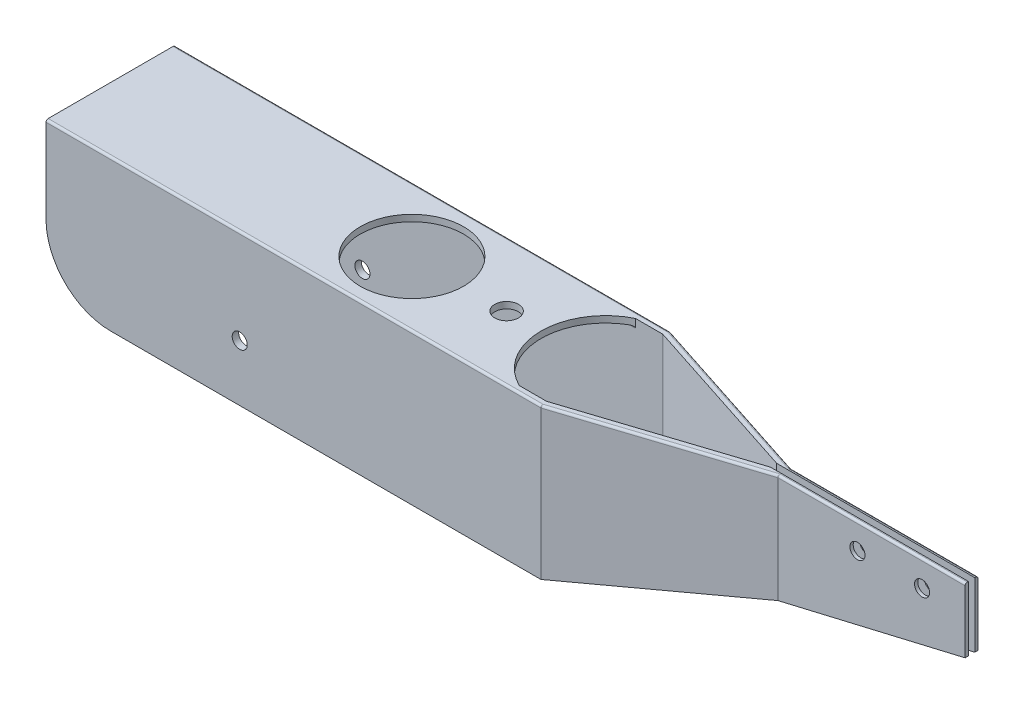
ISO-10303-21;
HEADER;
FILE_DESCRIPTION(('STEP AP214'),'2;1');
FILE_NAME('part.step','',(''),(''),'','','');
FILE_SCHEMA(('AUTOMOTIVE_DESIGN { 1 0 10303 214 1 1 1 1 }'));
ENDSEC;
DATA;
#1=APPLICATION_CONTEXT('core data for automotive mechanical design processes');
#2=APPLICATION_PROTOCOL_DEFINITION('international standard','automotive_design',2000,#1);
#3=PRODUCT_CONTEXT('',#1,'mechanical');
#4=PRODUCT('Part','Part','',(#3));
#5=PRODUCT_RELATED_PRODUCT_CATEGORY('part','',(#4));
#6=PRODUCT_DEFINITION_FORMATION('','',#4);
#7=PRODUCT_DEFINITION_CONTEXT('part definition',#1,'design');
#8=PRODUCT_DEFINITION('design','',#6,#7);
#9=PRODUCT_DEFINITION_SHAPE('','',#8);
#10=(LENGTH_UNIT() NAMED_UNIT(*) SI_UNIT(.MILLI.,.METRE.));
#11=(NAMED_UNIT(*) PLANE_ANGLE_UNIT() SI_UNIT($,.RADIAN.));
#12=(NAMED_UNIT(*) SI_UNIT($,.STERADIAN.) SOLID_ANGLE_UNIT());
#13=UNCERTAINTY_MEASURE_WITH_UNIT(LENGTH_MEASURE(1.E-05),#10,'distance_accuracy_value','');
#14=(GEOMETRIC_REPRESENTATION_CONTEXT(3) GLOBAL_UNCERTAINTY_ASSIGNED_CONTEXT((#13)) GLOBAL_UNIT_ASSIGNED_CONTEXT((#10,
#11,#12)) REPRESENTATION_CONTEXT('',''));
#15=CARTESIAN_POINT('',(0.,0.,0.));
#16=DIRECTION('',(0.,0.,1.));
#17=DIRECTION('',(1.,0.,0.));
#18=AXIS2_PLACEMENT_3D('',#15,#16,#17);
#19=CARTESIAN_POINT('',(0.,0.,-30.));
#20=DIRECTION('',(0.,-1.,0.));
#21=DIRECTION('',(0.,0.,-1.));
#22=AXIS2_PLACEMENT_3D('',#19,#20,#21);
#23=PLANE('',#22);
#24=DIRECTION('',(0.,0.,1.));
#25=VECTOR('',#24,1.);
#26=CARTESIAN_POINT('',(114.920807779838,0.,-30.));
#27=LINE('',#26,#25);
#28=CARTESIAN_POINT('',(114.920807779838,0.,-1.55146222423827));
#29=VERTEX_POINT('',#28);
#30=CARTESIAN_POINT('',(114.920807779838,0.,0.));
#31=VERTEX_POINT('',#30);
#32=EDGE_CURVE('E245',#29,#31,#27,.T.);
#33=ORIENTED_EDGE('',*,*,#32,.T.);
#34=DIRECTION('',(1.,0.,0.));
#35=VECTOR('',#34,1.);
#36=CARTESIAN_POINT('',(0.,0.,0.));
#37=LINE('',#36,#35);
#38=CARTESIAN_POINT('',(15.,0.,0.));
#39=VERTEX_POINT('',#38);
#40=EDGE_CURVE('E257',#39,#31,#37,.T.);
#41=ORIENTED_EDGE('',*,*,#40,.F.);
#42=DIRECTION('',(0.,0.,1.));
#43=VECTOR('',#42,1.);
#44=CARTESIAN_POINT('',(15.,0.,-1.5));
#45=LINE('',#44,#43);
#46=CARTESIAN_POINT('',(15.,0.,-1.5));
#47=VERTEX_POINT('',#46);
#48=EDGE_CURVE('E469',#39,#47,#45,.F.);
#49=ORIENTED_EDGE('',*,*,#48,.T.);
#50=DIRECTION('',(1.,0.,0.));
#51=VECTOR('',#50,1.);
#52=CARTESIAN_POINT('',(0.,0.,-1.5));
#53=LINE('',#52,#51);
#54=CARTESIAN_POINT('',(114.683231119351,0.,-1.5));
#55=VERTEX_POINT('',#54);
#56=EDGE_CURVE('E434',#47,#55,#53,.T.);
#57=ORIENTED_EDGE('',*,*,#56,.T.);
#58=CARTESIAN_POINT('',(114.683231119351,0.,-2.));
#59=DIRECTION('',(0.,-1.,0.));
#60=DIRECTION('',(0.,0.,-1.));
#61=AXIS2_PLACEMENT_3D('',#58,#59,#60);
#62=CIRCLE('',#61,0.5);
#63=CARTESIAN_POINT('',(114.837739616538,0.,-1.52447174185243));
#64=VERTEX_POINT('',#63);
#65=EDGE_CURVE('E306',#55,#64,#62,.F.);
#66=ORIENTED_EDGE('',*,*,#65,.T.);
#67=DIRECTION('',(-0.951056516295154,0.,0.309016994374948));
#68=VECTOR('',#67,1.);
#69=CARTESIAN_POINT('',(114.536474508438,0.,-1.42658477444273));
#70=LINE('',#69,#68);
#71=EDGE_CURVE('E260',#29,#64,#70,.T.);
#72=ORIENTED_EDGE('',*,*,#71,.F.);
#73=EDGE_LOOP('',(#33,#41,#49,#57,#66,#72));
#74=FACE_BOUND('',#73,.T.);
#75=ADVANCED_FACE('F30',(#74),#23,.T.);
#76=CARTESIAN_POINT('',(200.,35.,0.));
#77=DIRECTION('',(-1.,0.,0.));
#78=DIRECTION('',(0.,0.,1.));
#79=AXIS2_PLACEMENT_3D('',#76,#77,#78);
#80=PLANE('',#79);
#81=DIRECTION('',(0.,1.,0.));
#82=VECTOR('',#81,1.);
#83=CARTESIAN_POINT('',(200.,0.,-13.5));
#84=LINE('',#83,#82);
#85=CARTESIAN_POINT('',(200.,20.,-13.5));
#86=VERTEX_POINT('',#85);
#87=CARTESIAN_POINT('',(200.,34.5,-13.5));
#88=VERTEX_POINT('',#87);
#89=EDGE_CURVE('E444',#86,#88,#84,.T.);
#90=ORIENTED_EDGE('',*,*,#89,.F.);
#91=DIRECTION('',(0.,0.,1.));
#92=VECTOR('',#91,1.);
#93=CARTESIAN_POINT('',(200.,20.,-30.));
#94=LINE('',#93,#92);
#95=CARTESIAN_POINT('',(200.,20.,-14.2593824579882));
#96=VERTEX_POINT('',#95);
#97=EDGE_CURVE('E644',#96,#86,#94,.T.);
#98=ORIENTED_EDGE('',*,*,#97,.F.);
#99=DIRECTION('',(0.,1.,0.));
#100=VECTOR('',#99,1.);
#101=CARTESIAN_POINT('',(200.,35.,-14.2593824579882));
#102=LINE('',#101,#100);
#103=CARTESIAN_POINT('',(200.,35.,-14.2593824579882));
#104=VERTEX_POINT('',#103);
#105=EDGE_CURVE('E594',#96,#104,#102,.T.);
#106=ORIENTED_EDGE('',*,*,#105,.T.);
#107=DIRECTION('',(0.,0.,-1.));
#108=VECTOR('',#107,1.);
#109=CARTESIAN_POINT('',(200.,35.,0.));
#110=LINE('',#109,#108);
#111=CARTESIAN_POINT('',(200.,35.,-14.));
#112=VERTEX_POINT('',#111);
#113=EDGE_CURVE('E453',#112,#104,#110,.T.);
#114=ORIENTED_EDGE('',*,*,#113,.F.);
#115=CARTESIAN_POINT('',(200.,34.5,-14.));
#116=DIRECTION('',(-1.,0.,0.));
#117=DIRECTION('',(0.,0.,1.));
#118=AXIS2_PLACEMENT_3D('',#115,#116,#117);
#119=CIRCLE('',#118,0.5);
#120=EDGE_CURVE('E525',#112,#88,#119,.F.);
#121=ORIENTED_EDGE('',*,*,#120,.T.);
#122=EDGE_LOOP('',(#90,#98,#106,#114,#121));
#123=FACE_BOUND('',#122,.T.);
#124=ADVANCED_FACE('F402',(#123),#80,.F.);
#125=CARTESIAN_POINT('',(114.920807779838,0.,-30.));
#126=VERTEX_POINT('',#125);
#127=CARTESIAN_POINT('',(114.920807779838,0.,-28.4485377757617));
#128=VERTEX_POINT('',#127);
#129=EDGE_CURVE('E261',#126,#128,#27,.T.);
#130=ORIENTED_EDGE('',*,*,#129,.T.);
#131=DIRECTION('',(0.951056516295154,0.,0.309016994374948));
#132=VECTOR('',#131,1.);
#133=CARTESIAN_POINT('',(114.536474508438,0.,-28.5734152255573));
#134=LINE('',#133,#132);
#135=CARTESIAN_POINT('',(114.837739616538,0.,-28.4755282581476));
#136=VERTEX_POINT('',#135);
#137=EDGE_CURVE('E423',#136,#128,#134,.T.);
#138=ORIENTED_EDGE('',*,*,#137,.F.);
#139=CARTESIAN_POINT('',(114.683231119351,0.,-28.));
#140=DIRECTION('',(0.,-1.,0.));
#141=DIRECTION('',(0.,0.,-1.));
#142=AXIS2_PLACEMENT_3D('',#139,#140,#141);
#143=CIRCLE('',#142,0.5);
#144=CARTESIAN_POINT('',(114.683231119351,0.,-28.5));
#145=VERTEX_POINT('',#144);
#146=EDGE_CURVE('E38',#136,#145,#143,.F.);
#147=ORIENTED_EDGE('',*,*,#146,.T.);
#148=DIRECTION('',(-1.,0.,0.));
#149=VECTOR('',#148,1.);
#150=CARTESIAN_POINT('',(0.,0.,-28.5));
#151=LINE('',#150,#149);
#152=CARTESIAN_POINT('',(15.,0.,-28.5));
#153=VERTEX_POINT('',#152);
#154=EDGE_CURVE('E437',#145,#153,#151,.T.);
#155=ORIENTED_EDGE('',*,*,#154,.T.);
#156=DIRECTION('',(0.,0.,1.));
#157=VECTOR('',#156,1.);
#158=CARTESIAN_POINT('',(15.,0.,-30.));
#159=LINE('',#158,#157);
#160=CARTESIAN_POINT('',(15.,0.,-30.));
#161=VERTEX_POINT('',#160);
#162=EDGE_CURVE('E467',#153,#161,#159,.F.);
#163=ORIENTED_EDGE('',*,*,#162,.T.);
#164=DIRECTION('',(-1.,0.,0.));
#165=VECTOR('',#164,1.);
#166=CARTESIAN_POINT('',(0.,0.,-30.));
#167=LINE('',#166,#165);
#168=EDGE_CURVE('E269',#126,#161,#167,.T.);
#169=ORIENTED_EDGE('',*,*,#168,.F.);
#170=EDGE_LOOP('',(#130,#138,#147,#155,#163,#169));
#171=FACE_BOUND('',#170,.T.);
#172=ADVANCED_FACE('F404',(#171),#23,.T.);
#173=CARTESIAN_POINT('',(0.,35.,0.));
#174=DIRECTION('',(1.,0.,0.));
#175=DIRECTION('',(0.,0.,-1.));
#176=AXIS2_PLACEMENT_3D('',#173,#174,#175);
#177=PLANE('',#176);
#178=DIRECTION('',(0.,-1.,0.));
#179=VECTOR('',#178,1.);
#180=CARTESIAN_POINT('',(0.,35.,0.));
#181=LINE('',#180,#179);
#182=CARTESIAN_POINT('',(0.,34.5,0.));
#183=VERTEX_POINT('',#182);
#184=CARTESIAN_POINT('',(0.,15.,0.));
#185=VERTEX_POINT('',#184);
#186=EDGE_CURVE('E458',#183,#185,#181,.T.);
#187=ORIENTED_EDGE('',*,*,#186,.F.);
#188=CARTESIAN_POINT('',(0.,34.5,-0.5));
#189=DIRECTION('',(1.,0.,0.));
#190=DIRECTION('',(0.,0.,-1.));
#191=AXIS2_PLACEMENT_3D('',#188,#189,#190);
#192=CIRCLE('',#191,0.5);
#193=CARTESIAN_POINT('',(0.,35.,-0.5));
#194=VERTEX_POINT('',#193);
#195=EDGE_CURVE('E517',#183,#194,#192,.F.);
#196=ORIENTED_EDGE('',*,*,#195,.T.);
#197=DIRECTION('',(0.,0.,1.));
#198=VECTOR('',#197,1.);
#199=CARTESIAN_POINT('',(0.,35.,0.));
#200=LINE('',#199,#198);
#201=CARTESIAN_POINT('',(0.,35.,-29.5));
#202=VERTEX_POINT('',#201);
#203=EDGE_CURVE('E449',#202,#194,#200,.T.);
#204=ORIENTED_EDGE('',*,*,#203,.F.);
#205=CARTESIAN_POINT('',(0.,34.5,-29.5));
#206=DIRECTION('',(1.,0.,0.));
#207=DIRECTION('',(0.,0.,-1.));
#208=AXIS2_PLACEMENT_3D('',#205,#206,#207);
#209=CIRCLE('',#208,0.5);
#210=CARTESIAN_POINT('',(0.,34.5,-30.));
#211=VERTEX_POINT('',#210);
#212=EDGE_CURVE('E515',#202,#211,#209,.F.);
#213=ORIENTED_EDGE('',*,*,#212,.T.);
#214=DIRECTION('',(0.,-1.,0.));
#215=VECTOR('',#214,1.);
#216=CARTESIAN_POINT('',(0.,35.,-30.));
#217=LINE('',#216,#215);
#218=CARTESIAN_POINT('',(0.,15.,-30.));
#219=VERTEX_POINT('',#218);
#220=EDGE_CURVE('E456',#211,#219,#217,.T.);
#221=ORIENTED_EDGE('',*,*,#220,.T.);
#222=DIRECTION('',(0.,0.,1.));
#223=VECTOR('',#222,1.);
#224=CARTESIAN_POINT('',(0.,15.,-28.5));
#225=LINE('',#224,#223);
#226=CARTESIAN_POINT('',(0.,15.,-28.5));
#227=VERTEX_POINT('',#226);
#228=EDGE_CURVE('E460',#219,#227,#225,.T.);
#229=ORIENTED_EDGE('',*,*,#228,.T.);
#230=DIRECTION('',(0.,-1.,0.));
#231=VECTOR('',#230,1.);
#232=CARTESIAN_POINT('',(0.,35.,-28.5));
#233=LINE('',#232,#231);
#234=CARTESIAN_POINT('',(0.,33.,-28.5));
#235=VERTEX_POINT('',#234);
#236=EDGE_CURVE('E664',#235,#227,#233,.T.);
#237=ORIENTED_EDGE('',*,*,#236,.F.);
#238=CARTESIAN_POINT('',(0.,33.,-28.));
#239=DIRECTION('',(1.,0.,0.));
#240=DIRECTION('',(0.,0.,-1.));
#241=AXIS2_PLACEMENT_3D('',#238,#239,#240);
#242=CIRCLE('',#241,0.5);
#243=CARTESIAN_POINT('',(0.,33.5,-28.));
#244=VERTEX_POINT('',#243);
#245=EDGE_CURVE('E696',#235,#244,#242,.T.);
#246=ORIENTED_EDGE('',*,*,#245,.T.);
#247=DIRECTION('',(0.,0.,1.));
#248=VECTOR('',#247,1.);
#249=CARTESIAN_POINT('',(0.,33.5,-30.));
#250=LINE('',#249,#248);
#251=CARTESIAN_POINT('',(0.,33.5,-2.));
#252=VERTEX_POINT('',#251);
#253=EDGE_CURVE('E665',#244,#252,#250,.T.);
#254=ORIENTED_EDGE('',*,*,#253,.T.);
#255=CARTESIAN_POINT('',(0.,33.,-2.));
#256=DIRECTION('',(1.,0.,0.));
#257=DIRECTION('',(0.,0.,-1.));
#258=AXIS2_PLACEMENT_3D('',#255,#256,#257);
#259=CIRCLE('',#258,0.5);
#260=CARTESIAN_POINT('',(0.,33.,-1.5));
#261=VERTEX_POINT('',#260);
#262=EDGE_CURVE('E315',#252,#261,#259,.T.);
#263=ORIENTED_EDGE('',*,*,#262,.T.);
#264=DIRECTION('',(0.,-1.,0.));
#265=VECTOR('',#264,1.);
#266=CARTESIAN_POINT('',(0.,35.,-1.5));
#267=LINE('',#266,#265);
#268=CARTESIAN_POINT('',(0.,15.,-1.5));
#269=VERTEX_POINT('',#268);
#270=EDGE_CURVE('E446',#261,#269,#267,.T.);
#271=ORIENTED_EDGE('',*,*,#270,.T.);
#272=DIRECTION('',(0.,0.,1.));
#273=VECTOR('',#272,1.);
#274=CARTESIAN_POINT('',(0.,15.,0.));
#275=LINE('',#274,#273);
#276=EDGE_CURVE('E463',#269,#185,#275,.T.);
#277=ORIENTED_EDGE('',*,*,#276,.T.);
#278=EDGE_LOOP('',(#187,#196,#204,#213,#221,#229,#237,#246,#254,#263,#271,#277));
#279=FACE_BOUND('',#278,.T.);
#280=ADVANCED_FACE('F32',(#279),#177,.F.);
#281=CARTESIAN_POINT('',(0.,35.,0.));
#282=DIRECTION('',(0.,0.,-1.));
#283=DIRECTION('',(-1.,0.,0.));
#284=AXIS2_PLACEMENT_3D('',#281,#282,#283);
#285=PLANE('',#284);
#286=CARTESIAN_POINT('',(45.,13.06995079,0.));
#287=DIRECTION('',(0.,0.,1.));
#288=DIRECTION('',(1.,0.,0.));
#289=AXIS2_PLACEMENT_3D('',#286,#287,#288);
#290=CIRCLE('',#289,1.75);
#291=CARTESIAN_POINT('',(46.75,13.06995079,0.));
#292=VERTEX_POINT('',#291);
#293=EDGE_CURVE('E497',#292,#292,#290,.T.);
#294=ORIENTED_EDGE('',*,*,#293,.F.);
#295=EDGE_LOOP('',(#294));
#296=FACE_BOUND('',#295,.T.);
#297=ORIENTED_EDGE('',*,*,#40,.T.);
#298=DIRECTION('',(0.,1.,0.));
#299=VECTOR('',#298,1.);
#300=CARTESIAN_POINT('',(114.920807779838,35.,0.));
#301=LINE('',#300,#299);
#302=CARTESIAN_POINT('',(114.920807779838,34.5,0.));
#303=VERTEX_POINT('',#302);
#304=EDGE_CURVE('E265',#31,#303,#301,.T.);
#305=ORIENTED_EDGE('',*,*,#304,.T.);
#306=DIRECTION('',(1.,0.,0.));
#307=VECTOR('',#306,1.);
#308=CARTESIAN_POINT('',(0.,34.5,0.));
#309=LINE('',#308,#307);
#310=EDGE_CURVE('E513',#303,#183,#309,.F.);
#311=ORIENTED_EDGE('',*,*,#310,.T.);
#312=ORIENTED_EDGE('',*,*,#186,.T.);
#313=CARTESIAN_POINT('',(15.,15.,0.));
#314=DIRECTION('',(0.,0.,-1.));
#315=DIRECTION('',(-1.,0.,0.));
#316=AXIS2_PLACEMENT_3D('',#313,#314,#315);
#317=CIRCLE('',#316,15.);
#318=EDGE_CURVE('E268',#185,#39,#317,.F.);
#319=ORIENTED_EDGE('',*,*,#318,.T.);
#320=EDGE_LOOP('',(#297,#305,#311,#312,#319));
#321=FACE_BOUND('',#320,.T.);
#322=ADVANCED_FACE('F264',(#296,#321),#285,.F.);
#323=DIRECTION('',(0.,-1.,0.));
#324=VECTOR('',#323,1.);
#325=CARTESIAN_POINT('',(200.,35.,-15.7593824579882));
#326=LINE('',#325,#324);
#327=CARTESIAN_POINT('',(200.,35.,-15.7593824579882));
#328=VERTEX_POINT('',#327);
#329=CARTESIAN_POINT('',(200.,20.,-15.7593824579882));
#330=VERTEX_POINT('',#329);
#331=EDGE_CURVE('E605',#328,#330,#326,.T.);
#332=ORIENTED_EDGE('',*,*,#331,.T.);
#333=CARTESIAN_POINT('',(200.,20.,-16.5));
#334=VERTEX_POINT('',#333);
#335=EDGE_CURVE('E53',#334,#330,#94,.T.);
#336=ORIENTED_EDGE('',*,*,#335,.F.);
#337=DIRECTION('',(0.,1.,0.));
#338=VECTOR('',#337,1.);
#339=CARTESIAN_POINT('',(200.,0.,-16.5));
#340=LINE('',#339,#338);
#341=CARTESIAN_POINT('',(200.,34.5,-16.5));
#342=VERTEX_POINT('',#341);
#343=EDGE_CURVE('E270',#334,#342,#340,.T.);
#344=ORIENTED_EDGE('',*,*,#343,.T.);
#345=CARTESIAN_POINT('',(200.,34.5,-16.));
#346=DIRECTION('',(-1.,0.,0.));
#347=DIRECTION('',(0.,0.,1.));
#348=AXIS2_PLACEMENT_3D('',#345,#346,#347);
#349=CIRCLE('',#348,0.5);
#350=CARTESIAN_POINT('',(200.,35.,-16.));
#351=VERTEX_POINT('',#350);
#352=EDGE_CURVE('E531',#342,#351,#349,.F.);
#353=ORIENTED_EDGE('',*,*,#352,.T.);
#354=EDGE_CURVE('E452',#328,#351,#110,.T.);
#355=ORIENTED_EDGE('',*,*,#354,.F.);
#356=EDGE_LOOP('',(#332,#336,#344,#353,#355));
#357=FACE_BOUND('',#356,.T.);
#358=ADVANCED_FACE('F410',(#357),#80,.F.);
#359=CARTESIAN_POINT('',(0.,35.,-30.));
#360=DIRECTION('',(0.,0.,1.));
#361=DIRECTION('',(1.,0.,0.));
#362=AXIS2_PLACEMENT_3D('',#359,#360,#361);
#363=PLANE('',#362);
#364=CARTESIAN_POINT('',(45.,13.06995079,-30.));
#365=DIRECTION('',(0.,0.,1.));
#366=DIRECTION('',(1.,0.,0.));
#367=AXIS2_PLACEMENT_3D('',#364,#365,#366);
#368=CIRCLE('',#367,1.75);
#369=CARTESIAN_POINT('',(46.75,13.06995079,-30.));
#370=VERTEX_POINT('',#369);
#371=EDGE_CURVE('E1141',#370,#370,#368,.T.);
#372=ORIENTED_EDGE('',*,*,#371,.T.);
#373=EDGE_LOOP('',(#372));
#374=FACE_BOUND('',#373,.T.);
#375=DIRECTION('',(-1.,0.,0.));
#376=VECTOR('',#375,1.);
#377=CARTESIAN_POINT('',(0.,34.5,-30.));
#378=LINE('',#377,#376);
#379=CARTESIAN_POINT('',(114.920807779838,34.5,-30.));
#380=VERTEX_POINT('',#379);
#381=EDGE_CURVE('E537',#211,#380,#378,.F.);
#382=ORIENTED_EDGE('',*,*,#381,.T.);
#383=DIRECTION('',(0.,1.,0.));
#384=VECTOR('',#383,1.);
#385=CARTESIAN_POINT('',(114.920807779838,35.,-30.));
#386=LINE('',#385,#384);
#387=EDGE_CURVE('E557',#380,#126,#386,.F.);
#388=ORIENTED_EDGE('',*,*,#387,.T.);
#389=ORIENTED_EDGE('',*,*,#168,.T.);
#390=CARTESIAN_POINT('',(15.,15.,-30.));
#391=DIRECTION('',(0.,0.,1.));
#392=DIRECTION('',(1.,0.,0.));
#393=AXIS2_PLACEMENT_3D('',#390,#391,#392);
#394=CIRCLE('',#393,15.);
#395=EDGE_CURVE('E477',#161,#219,#394,.F.);
#396=ORIENTED_EDGE('',*,*,#395,.T.);
#397=ORIENTED_EDGE('',*,*,#220,.F.);
#398=EDGE_LOOP('',(#382,#388,#389,#396,#397));
#399=FACE_BOUND('',#398,.T.);
#400=ADVANCED_FACE('F683',(#374,#399),#363,.F.);
#401=CARTESIAN_POINT('',(0.,35.,-30.));
#402=DIRECTION('',(0.,-1.,0.));
#403=DIRECTION('',(0.,0.,-1.));
#404=AXIS2_PLACEMENT_3D('',#401,#402,#403);
#405=PLANE('',#404);
#406=CARTESIAN_POINT('',(92.,35.,-15.));
#407=DIRECTION('',(0.,1.,0.));
#408=DIRECTION('',(0.,0.,1.));
#409=AXIS2_PLACEMENT_3D('',#406,#407,#408);
#410=CIRCLE('',#409,2.75000000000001);
#411=CARTESIAN_POINT('',(92.,35.,-12.25));
#412=VERTEX_POINT('',#411);
#413=EDGE_CURVE('E492',#412,#412,#410,.T.);
#414=ORIENTED_EDGE('',*,*,#413,.F.);
#415=EDGE_LOOP('',(#414));
#416=FACE_BOUND('',#415,.T.);
#417=CARTESIAN_POINT('',(70.,35.,-15.));
#418=DIRECTION('',(0.,1.,0.));
#419=DIRECTION('',(0.,0.,1.));
#420=AXIS2_PLACEMENT_3D('',#417,#418,#419);
#421=CIRCLE('',#420,12.);
#422=CARTESIAN_POINT('',(70.,35.,-3.));
#423=VERTEX_POINT('',#422);
#424=EDGE_CURVE('E488',#423,#423,#421,.T.);
#425=ORIENTED_EDGE('',*,*,#424,.F.);
#426=EDGE_LOOP('',(#425));
#427=FACE_BOUND('',#426,.T.);
#428=ORIENTED_EDGE('',*,*,#113,.T.);
#429=DIRECTION('',(1.,0.,0.));
#430=VECTOR('',#429,1.);
#431=CARTESIAN_POINT('',(201.105370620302,35.,-14.2593824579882));
#432=LINE('',#431,#430);
#433=CARTESIAN_POINT('',(154.031764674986,35.,-14.2593824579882));
#434=VERTEX_POINT('',#433);
#435=EDGE_CURVE('E600',#434,#104,#432,.T.);
#436=ORIENTED_EDGE('',*,*,#435,.F.);
#437=DIRECTION('',(0.951056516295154,0.,-0.309016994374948));
#438=VECTOR('',#437,1.);
#439=CARTESIAN_POINT('',(114.762423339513,35.,-1.5));
#440=LINE('',#439,#438);
#441=CARTESIAN_POINT('',(114.837739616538,35.,-1.52447174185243));
#442=VERTEX_POINT('',#441);
#443=EDGE_CURVE('E650',#442,#434,#440,.T.);
#444=ORIENTED_EDGE('',*,*,#443,.F.);
#445=CARTESIAN_POINT('',(114.683231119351,35.,-2.));
#446=DIRECTION('',(0.,-1.,0.));
#447=DIRECTION('',(0.,0.,-1.));
#448=AXIS2_PLACEMENT_3D('',#445,#446,#447);
#449=CIRCLE('',#448,0.5);
#450=CARTESIAN_POINT('',(114.683231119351,35.,-1.5));
#451=VERTEX_POINT('',#450);
#452=EDGE_CURVE('E304',#442,#451,#449,.T.);
#453=ORIENTED_EDGE('',*,*,#452,.T.);
#454=DIRECTION('',(1.,0.,0.));
#455=VECTOR('',#454,1.);
#456=CARTESIAN_POINT('',(114.762423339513,35.,-1.5));
#457=LINE('',#456,#455);
#458=CARTESIAN_POINT('',(108.461651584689,35.,-1.5));
#459=VERTEX_POINT('',#458);
#460=EDGE_CURVE('E653',#459,#451,#457,.T.);
#461=ORIENTED_EDGE('',*,*,#460,.F.);
#462=CARTESIAN_POINT('',(115.,35.,-15.));
#463=DIRECTION('',(0.,1.,0.));
#464=DIRECTION('',(0.,0.,1.));
#465=AXIS2_PLACEMENT_3D('',#462,#463,#464);
#466=CIRCLE('',#465,15.);
#467=CARTESIAN_POINT('',(108.461651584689,35.,-28.5));
#468=VERTEX_POINT('',#467);
#469=EDGE_CURVE('E658',#468,#459,#466,.T.);
#470=ORIENTED_EDGE('',*,*,#469,.F.);
#471=DIRECTION('',(-1.,0.,0.));
#472=VECTOR('',#471,1.);
#473=CARTESIAN_POINT('',(114.762423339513,35.,-28.5));
#474=LINE('',#473,#472);
#475=CARTESIAN_POINT('',(114.683231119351,35.,-28.5));
#476=VERTEX_POINT('',#475);
#477=EDGE_CURVE('E717',#476,#468,#474,.T.);
#478=ORIENTED_EDGE('',*,*,#477,.F.);
#479=CARTESIAN_POINT('',(114.683231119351,35.,-28.));
#480=DIRECTION('',(0.,-1.,0.));
#481=DIRECTION('',(0.,0.,-1.));
#482=AXIS2_PLACEMENT_3D('',#479,#480,#481);
#483=CIRCLE('',#482,0.5);
#484=CARTESIAN_POINT('',(114.837739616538,35.,-28.4755282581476));
#485=VERTEX_POINT('',#484);
#486=EDGE_CURVE('E690',#476,#485,#483,.T.);
#487=ORIENTED_EDGE('',*,*,#486,.T.);
#488=DIRECTION('',(-0.951056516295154,0.,-0.309016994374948));
#489=VECTOR('',#488,1.);
#490=CARTESIAN_POINT('',(114.762423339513,35.,-28.5));
#491=LINE('',#490,#489);
#492=CARTESIAN_POINT('',(153.974012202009,35.,-15.7593824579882));
#493=VERTEX_POINT('',#492);
#494=EDGE_CURVE('E487',#493,#485,#491,.T.);
#495=ORIENTED_EDGE('',*,*,#494,.F.);
#496=DIRECTION('',(-1.,0.,0.));
#497=VECTOR('',#496,1.);
#498=CARTESIAN_POINT('',(201.105370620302,35.,-15.7593824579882));
#499=LINE('',#498,#497);
#500=EDGE_CURVE('E623',#328,#493,#499,.T.);
#501=ORIENTED_EDGE('',*,*,#500,.F.);
#502=ORIENTED_EDGE('',*,*,#354,.T.);
#503=DIRECTION('',(1.,0.,0.));
#504=VECTOR('',#503,1.);
#505=CARTESIAN_POINT('',(0.,35.,-15.9999999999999));
#506=LINE('',#505,#504);
#507=CARTESIAN_POINT('',(156.469535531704,35.,-16.));
#508=VERTEX_POINT('',#507);
#509=EDGE_CURVE('E502',#351,#508,#506,.F.);
#510=ORIENTED_EDGE('',*,*,#509,.T.);
#511=DIRECTION('',(0.951056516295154,0.,0.309016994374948));
#512=VECTOR('',#511,1.);
#513=CARTESIAN_POINT('',(10.8270143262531,35.,-63.3221237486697));
#514=LINE('',#513,#512);
#515=CARTESIAN_POINT('',(114.920807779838,35.,-29.5));
#516=VERTEX_POINT('',#515);
#517=EDGE_CURVE('E499',#508,#516,#514,.F.);
#518=ORIENTED_EDGE('',*,*,#517,.T.);
#519=DIRECTION('',(-1.,0.,0.));
#520=VECTOR('',#519,1.);
#521=CARTESIAN_POINT('',(0.,35.,-29.5));
#522=LINE('',#521,#520);
#523=EDGE_CURVE('E483',#516,#202,#522,.T.);
#524=ORIENTED_EDGE('',*,*,#523,.T.);
#525=ORIENTED_EDGE('',*,*,#203,.T.);
#526=DIRECTION('',(1.,0.,0.));
#527=VECTOR('',#526,1.);
#528=CARTESIAN_POINT('',(0.,35.,-0.5));
#529=LINE('',#528,#527);
#530=CARTESIAN_POINT('',(114.920807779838,35.,-0.499999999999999));
#531=VERTEX_POINT('',#530);
#532=EDGE_CURVE('E510',#194,#531,#529,.T.);
#533=ORIENTED_EDGE('',*,*,#532,.T.);
#534=DIRECTION('',(-0.951056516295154,0.,0.309016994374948));
#535=VECTOR('',#534,1.);
#536=CARTESIAN_POINT('',(19.6437931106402,35.,30.4573786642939));
#537=LINE('',#536,#535);
#538=CARTESIAN_POINT('',(156.469535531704,35.,-14.));
#539=VERTEX_POINT('',#538);
#540=EDGE_CURVE('E507',#531,#539,#537,.F.);
#541=ORIENTED_EDGE('',*,*,#540,.T.);
#542=DIRECTION('',(-1.,0.,0.));
#543=VECTOR('',#542,1.);
#544=CARTESIAN_POINT('',(0.,35.,-14.0000000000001));
#545=LINE('',#544,#543);
#546=EDGE_CURVE('E505',#539,#112,#545,.F.);
#547=ORIENTED_EDGE('',*,*,#546,.T.);
#548=EDGE_LOOP('',(#428,#436,#444,#453,#461,#470,#478,#487,#495,#501,#502,#510,#518,#524,#525,
#533,#541,#547));
#549=FACE_BOUND('',#548,.T.);
#550=ADVANCED_FACE('F598',(#416,#427,#549),#405,.F.);
#551=CARTESIAN_POINT('',(115.,0.,-30.));
#552=DIRECTION('',(-0.309016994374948,0.,0.951056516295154));
#553=DIRECTION('',(0.951056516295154,0.,0.309016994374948));
#554=AXIS2_PLACEMENT_3D('',#551,#552,#553);
#555=PLANE('',#554);
#556=DIRECTION('',(0.,1.,0.));
#557=VECTOR('',#556,1.);
#558=CARTESIAN_POINT('',(156.473411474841,0.,-16.5244717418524));
#559=LINE('',#558,#557);
#560=CARTESIAN_POINT('',(156.473411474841,34.5,-16.5244717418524));
#561=VERTEX_POINT('',#560);
#562=CARTESIAN_POINT('',(156.473411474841,9.76798265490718,-16.5244717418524));
#563=VERTEX_POINT('',#562);
#564=EDGE_CURVE('E554',#561,#563,#559,.F.);
#565=ORIENTED_EDGE('',*,*,#564,.T.);
#566=DIRECTION('',(-0.928143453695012,-0.218183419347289,-0.301572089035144));
#567=VECTOR('',#566,1.);
#568=CARTESIAN_POINT('',(114.996230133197,0.0177299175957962,-30.0012249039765));
#569=LINE('',#568,#567);
#570=CARTESIAN_POINT('',(115.075316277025,0.0363211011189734,-29.9755282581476));
#571=VERTEX_POINT('',#570);
#572=EDGE_CURVE('E631',#563,#571,#569,.T.);
#573=ORIENTED_EDGE('',*,*,#572,.T.);
#574=DIRECTION('',(0.,1.,0.));
#575=VECTOR('',#574,1.);
#576=CARTESIAN_POINT('',(115.075316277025,0.,-29.9755282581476));
#577=LINE('',#576,#575);
#578=CARTESIAN_POINT('',(115.075316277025,34.5,-29.9755282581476));
#579=VERTEX_POINT('',#578);
#580=EDGE_CURVE('E552',#571,#579,#577,.T.);
#581=ORIENTED_EDGE('',*,*,#580,.T.);
#582=DIRECTION('',(0.951056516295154,0.,0.309016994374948));
#583=VECTOR('',#582,1.);
#584=CARTESIAN_POINT('',(115.,34.5,-30.));
#585=LINE('',#584,#583);
#586=EDGE_CURVE('E534',#579,#561,#585,.T.);
#587=ORIENTED_EDGE('',*,*,#586,.T.);
#588=EDGE_LOOP('',(#565,#573,#581,#587));
#589=FACE_BOUND('',#588,.T.);
#590=ADVANCED_FACE('F868',(#589),#555,.F.);
#591=CARTESIAN_POINT('',(200.,0.,-16.5));
#592=DIRECTION('',(0.,0.,1.));
#593=DIRECTION('',(1.,0.,0.));
#594=AXIS2_PLACEMENT_3D('',#591,#592,#593);
#595=PLANE('',#594);
#596=CARTESIAN_POINT('',(190.,29.,-16.5));
#597=DIRECTION('',(0.,0.,1.));
#598=DIRECTION('',(1.,0.,0.));
#599=AXIS2_PLACEMENT_3D('',#596,#597,#598);
#600=CIRCLE('',#599,1.75000000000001);
#601=CARTESIAN_POINT('',(191.75,29.,-16.5));
#602=VERTEX_POINT('',#601);
#603=EDGE_CURVE('E1154',#602,#602,#600,.T.);
#604=ORIENTED_EDGE('',*,*,#603,.T.);
#605=EDGE_LOOP('',(#604));
#606=FACE_BOUND('',#605,.T.);
#607=CARTESIAN_POINT('',(175.,29.,-16.5));
#608=DIRECTION('',(0.,0.,1.));
#609=DIRECTION('',(1.,0.,0.));
#610=AXIS2_PLACEMENT_3D('',#607,#608,#609);
#611=CIRCLE('',#610,1.75000000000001);
#612=CARTESIAN_POINT('',(176.75,29.,-16.5));
#613=VERTEX_POINT('',#612);
#614=EDGE_CURVE('E1149',#613,#613,#611,.T.);
#615=ORIENTED_EDGE('',*,*,#614,.T.);
#616=EDGE_LOOP('',(#615));
#617=FACE_BOUND('',#616,.T.);
#618=ORIENTED_EDGE('',*,*,#343,.F.);
#619=DIRECTION('',(-0.973464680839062,-0.228837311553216,0.));
#620=VECTOR('',#619,1.);
#621=CARTESIAN_POINT('',(195.544699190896,18.9526696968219,-16.5));
#622=LINE('',#621,#620);
#623=CARTESIAN_POINT('',(156.627919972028,9.80430375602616,-16.5));
#624=VERTEX_POINT('',#623);
#625=EDGE_CURVE('E625',#334,#624,#622,.T.);
#626=ORIENTED_EDGE('',*,*,#625,.T.);
#627=DIRECTION('',(0.,1.,0.));
#628=VECTOR('',#627,1.);
#629=CARTESIAN_POINT('',(156.627919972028,34.5,-16.5));
#630=LINE('',#629,#628);
#631=CARTESIAN_POINT('',(156.627919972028,34.5,-16.5));
#632=VERTEX_POINT('',#631);
#633=EDGE_CURVE('E550',#624,#632,#630,.T.);
#634=ORIENTED_EDGE('',*,*,#633,.T.);
#635=DIRECTION('',(1.,0.,0.));
#636=VECTOR('',#635,1.);
#637=CARTESIAN_POINT('',(200.,34.5,-16.5));
#638=LINE('',#637,#636);
#639=EDGE_CURVE('E528',#632,#342,#638,.T.);
#640=ORIENTED_EDGE('',*,*,#639,.T.);
#641=EDGE_LOOP('',(#618,#626,#634,#640));
#642=FACE_BOUND('',#641,.T.);
#643=ADVANCED_FACE('F859',(#606,#617,#642),#595,.F.);
#644=CARTESIAN_POINT('',(115.,0.,0.));
#645=DIRECTION('',(-0.309016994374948,0.,-0.951056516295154));
#646=DIRECTION('',(-0.951056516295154,0.,0.309016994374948));
#647=AXIS2_PLACEMENT_3D('',#644,#645,#646);
#648=PLANE('',#647);
#649=DIRECTION('',(0.,1.,0.));
#650=VECTOR('',#649,1.);
#651=CARTESIAN_POINT('',(115.075316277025,0.,-0.0244717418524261));
#652=LINE('',#651,#650);
#653=CARTESIAN_POINT('',(115.075316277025,34.5,-0.024471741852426));
#654=VERTEX_POINT('',#653);
#655=CARTESIAN_POINT('',(115.075316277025,0.0363211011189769,-0.0244717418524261));
#656=VERTEX_POINT('',#655);
#657=EDGE_CURVE('E570',#654,#656,#652,.F.);
#658=ORIENTED_EDGE('',*,*,#657,.T.);
#659=DIRECTION('',(0.928143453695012,0.218183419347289,-0.301572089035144));
#660=VECTOR('',#659,1.);
#661=CARTESIAN_POINT('',(114.996230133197,0.0177299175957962,0.00122490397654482));
#662=LINE('',#661,#660);
#663=CARTESIAN_POINT('',(156.473411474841,9.76798265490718,-13.4755282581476));
#664=VERTEX_POINT('',#663);
#665=EDGE_CURVE('E247',#656,#664,#662,.T.);
#666=ORIENTED_EDGE('',*,*,#665,.T.);
#667=DIRECTION('',(0.,1.,0.));
#668=VECTOR('',#667,1.);
#669=CARTESIAN_POINT('',(156.473411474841,34.5,-13.4755282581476));
#670=LINE('',#669,#668);
#671=CARTESIAN_POINT('',(156.473411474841,34.5,-13.4755282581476));
#672=VERTEX_POINT('',#671);
#673=EDGE_CURVE('E284',#664,#672,#670,.T.);
#674=ORIENTED_EDGE('',*,*,#673,.T.);
#675=DIRECTION('',(-0.951056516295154,0.,0.309016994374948));
#676=VECTOR('',#675,1.);
#677=CARTESIAN_POINT('',(115.,34.5,0.));
#678=LINE('',#677,#676);
#679=EDGE_CURVE('E519',#672,#654,#678,.T.);
#680=ORIENTED_EDGE('',*,*,#679,.T.);
#681=EDGE_LOOP('',(#658,#666,#674,#680));
#682=FACE_BOUND('',#681,.T.);
#683=ADVANCED_FACE('F574',(#682),#648,.F.);
#684=CARTESIAN_POINT('',(200.,0.,-13.5));
#685=DIRECTION('',(0.,0.,-1.));
#686=DIRECTION('',(-1.,0.,0.));
#687=AXIS2_PLACEMENT_3D('',#684,#685,#686);
#688=PLANE('',#687);
#689=CARTESIAN_POINT('',(190.,29.,-13.5000000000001));
#690=DIRECTION('',(0.,0.,1.));
#691=DIRECTION('',(1.,0.,0.));
#692=AXIS2_PLACEMENT_3D('',#689,#690,#691);
#693=CIRCLE('',#692,1.75000000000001);
#694=CARTESIAN_POINT('',(191.75,29.,-13.5000000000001));
#695=VERTEX_POINT('',#694);
#696=EDGE_CURVE('E368',#695,#695,#693,.T.);
#697=ORIENTED_EDGE('',*,*,#696,.F.);
#698=EDGE_LOOP('',(#697));
#699=FACE_BOUND('',#698,.T.);
#700=CARTESIAN_POINT('',(175.,29.,-13.5000000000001));
#701=DIRECTION('',(0.,0.,1.));
#702=DIRECTION('',(1.,0.,0.));
#703=AXIS2_PLACEMENT_3D('',#700,#701,#702);
#704=CIRCLE('',#703,1.75000000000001);
#705=CARTESIAN_POINT('',(176.75,29.,-13.5000000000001));
#706=VERTEX_POINT('',#705);
#707=EDGE_CURVE('E1152',#706,#706,#704,.T.);
#708=ORIENTED_EDGE('',*,*,#707,.F.);
#709=EDGE_LOOP('',(#708));
#710=FACE_BOUND('',#709,.T.);
#711=DIRECTION('',(0.,1.,0.));
#712=VECTOR('',#711,1.);
#713=CARTESIAN_POINT('',(156.627919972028,0.,-13.5));
#714=LINE('',#713,#712);
#715=CARTESIAN_POINT('',(156.627919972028,34.5,-13.5));
#716=VERTEX_POINT('',#715);
#717=CARTESIAN_POINT('',(156.627919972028,9.80430375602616,-13.5));
#718=VERTEX_POINT('',#717);
#719=EDGE_CURVE('E278',#716,#718,#714,.F.);
#720=ORIENTED_EDGE('',*,*,#719,.T.);
#721=DIRECTION('',(0.973464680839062,0.228837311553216,0.));
#722=VECTOR('',#721,1.);
#723=CARTESIAN_POINT('',(195.544699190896,18.9526696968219,-13.5));
#724=LINE('',#723,#722);
#725=EDGE_CURVE('E590',#718,#86,#724,.T.);
#726=ORIENTED_EDGE('',*,*,#725,.T.);
#727=ORIENTED_EDGE('',*,*,#89,.T.);
#728=DIRECTION('',(-1.,0.,0.));
#729=VECTOR('',#728,1.);
#730=CARTESIAN_POINT('',(200.,34.5,-13.5));
#731=LINE('',#730,#729);
#732=EDGE_CURVE('E522',#88,#716,#731,.T.);
#733=ORIENTED_EDGE('',*,*,#732,.T.);
#734=EDGE_LOOP('',(#720,#726,#727,#733));
#735=FACE_BOUND('',#734,.T.);
#736=ADVANCED_FACE('F587',(#699,#710,#735),#688,.F.);
#737=CARTESIAN_POINT('',(0.,35.,-1.5));
#738=DIRECTION('',(0.,0.,-1.));
#739=DIRECTION('',(-1.,0.,0.));
#740=AXIS2_PLACEMENT_3D('',#737,#738,#739);
#741=PLANE('',#740);
#742=CARTESIAN_POINT('',(45.,13.06995079,-1.5));
#743=DIRECTION('',(0.,0.,-1.));
#744=DIRECTION('',(-1.,0.,0.));
#745=AXIS2_PLACEMENT_3D('',#742,#743,#744);
#746=CIRCLE('',#745,1.75);
#747=CARTESIAN_POINT('',(43.25,13.06995079,-1.5));
#748=VERTEX_POINT('',#747);
#749=EDGE_CURVE('E496',#748,#748,#746,.T.);
#750=ORIENTED_EDGE('',*,*,#749,.F.);
#751=EDGE_LOOP('',(#750));
#752=FACE_BOUND('',#751,.T.);
#753=ORIENTED_EDGE('',*,*,#460,.T.);
#754=DIRECTION('',(0.,1.,0.));
#755=VECTOR('',#754,1.);
#756=CARTESIAN_POINT('',(114.683231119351,0.,-1.5));
#757=LINE('',#756,#755);
#758=EDGE_CURVE('E290',#451,#55,#757,.F.);
#759=ORIENTED_EDGE('',*,*,#758,.T.);
#760=ORIENTED_EDGE('',*,*,#56,.F.);
#761=CARTESIAN_POINT('',(15.,15.,-1.5));
#762=DIRECTION('',(0.,0.,-1.));
#763=DIRECTION('',(-1.,0.,0.));
#764=AXIS2_PLACEMENT_3D('',#761,#762,#763);
#765=CIRCLE('',#764,15.);
#766=EDGE_CURVE('E471',#47,#269,#765,.T.);
#767=ORIENTED_EDGE('',*,*,#766,.T.);
#768=ORIENTED_EDGE('',*,*,#270,.F.);
#769=DIRECTION('',(1.,0.,0.));
#770=VECTOR('',#769,1.);
#771=CARTESIAN_POINT('',(108.461651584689,33.,-1.5));
#772=LINE('',#771,#770);
#773=CARTESIAN_POINT('',(108.461651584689,33.,-1.5));
#774=VERTEX_POINT('',#773);
#775=EDGE_CURVE('E281',#261,#774,#772,.T.);
#776=ORIENTED_EDGE('',*,*,#775,.T.);
#777=DIRECTION('',(0.,1.,0.));
#778=VECTOR('',#777,1.);
#779=CARTESIAN_POINT('',(108.461651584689,0.,-1.5));
#780=LINE('',#779,#778);
#781=EDGE_CURVE('E439',#774,#459,#780,.T.);
#782=ORIENTED_EDGE('',*,*,#781,.T.);
#783=EDGE_LOOP('',(#753,#759,#760,#767,#768,#776,#782));
#784=FACE_BOUND('',#783,.T.);
#785=ADVANCED_FACE('F729',(#752,#784),#741,.T.);
#786=CARTESIAN_POINT('',(0.,35.,-28.5));
#787=DIRECTION('',(0.,0.,1.));
#788=DIRECTION('',(1.,0.,0.));
#789=AXIS2_PLACEMENT_3D('',#786,#787,#788);
#790=PLANE('',#789);
#791=CARTESIAN_POINT('',(45.,13.06995079,-28.5));
#792=DIRECTION('',(0.,0.,1.));
#793=DIRECTION('',(1.,0.,0.));
#794=AXIS2_PLACEMENT_3D('',#791,#792,#793);
#795=CIRCLE('',#794,1.75);
#796=CARTESIAN_POINT('',(46.75,13.06995079,-28.5));
#797=VERTEX_POINT('',#796);
#798=EDGE_CURVE('E493',#797,#797,#795,.T.);
#799=ORIENTED_EDGE('',*,*,#798,.F.);
#800=EDGE_LOOP('',(#799));
#801=FACE_BOUND('',#800,.T.);
#802=DIRECTION('',(0.,1.,0.));
#803=VECTOR('',#802,1.);
#804=CARTESIAN_POINT('',(108.461651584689,0.,-28.5));
#805=LINE('',#804,#803);
#806=CARTESIAN_POINT('',(108.461651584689,33.,-28.5));
#807=VERTEX_POINT('',#806);
#808=EDGE_CURVE('E652',#807,#468,#805,.T.);
#809=ORIENTED_EDGE('',*,*,#808,.F.);
#810=DIRECTION('',(-1.,0.,0.));
#811=VECTOR('',#810,1.);
#812=CARTESIAN_POINT('',(0.,33.,-28.5));
#813=LINE('',#812,#811);
#814=EDGE_CURVE('E299',#807,#235,#813,.T.);
#815=ORIENTED_EDGE('',*,*,#814,.T.);
#816=ORIENTED_EDGE('',*,*,#236,.T.);
#817=CARTESIAN_POINT('',(15.,15.,-28.5));
#818=DIRECTION('',(0.,0.,1.));
#819=DIRECTION('',(1.,0.,0.));
#820=AXIS2_PLACEMENT_3D('',#817,#818,#819);
#821=CIRCLE('',#820,15.);
#822=EDGE_CURVE('E474',#227,#153,#821,.T.);
#823=ORIENTED_EDGE('',*,*,#822,.T.);
#824=ORIENTED_EDGE('',*,*,#154,.F.);
#825=DIRECTION('',(0.,1.,0.));
#826=VECTOR('',#825,1.);
#827=CARTESIAN_POINT('',(114.683231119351,35.,-28.5));
#828=LINE('',#827,#826);
#829=EDGE_CURVE('E296',#145,#476,#828,.T.);
#830=ORIENTED_EDGE('',*,*,#829,.T.);
#831=ORIENTED_EDGE('',*,*,#477,.T.);
#832=EDGE_LOOP('',(#809,#815,#816,#823,#824,#830,#831));
#833=FACE_BOUND('',#832,.T.);
#834=ADVANCED_FACE('F670',(#801,#833),#790,.T.);
#835=CARTESIAN_POINT('',(0.,33.5,-30.));
#836=DIRECTION('',(0.,-1.,0.));
#837=DIRECTION('',(0.,0.,-1.));
#838=AXIS2_PLACEMENT_3D('',#835,#836,#837);
#839=PLANE('',#838);
#840=CARTESIAN_POINT('',(92.,33.5,-15.));
#841=DIRECTION('',(0.,-1.,0.));
#842=DIRECTION('',(0.,0.,-1.));
#843=AXIS2_PLACEMENT_3D('',#840,#841,#842);
#844=CIRCLE('',#843,2.75000000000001);
#845=CARTESIAN_POINT('',(92.,33.5,-17.75));
#846=VERTEX_POINT('',#845);
#847=EDGE_CURVE('E489',#846,#846,#844,.T.);
#848=ORIENTED_EDGE('',*,*,#847,.F.);
#849=EDGE_LOOP('',(#848));
#850=FACE_BOUND('',#849,.T.);
#851=CARTESIAN_POINT('',(70.,33.5,-15.));
#852=DIRECTION('',(0.,-1.,0.));
#853=DIRECTION('',(0.,0.,-1.));
#854=AXIS2_PLACEMENT_3D('',#851,#852,#853);
#855=CIRCLE('',#854,12.);
#856=CARTESIAN_POINT('',(70.,33.5,-27.));
#857=VERTEX_POINT('',#856);
#858=EDGE_CURVE('E484',#857,#857,#855,.T.);
#859=ORIENTED_EDGE('',*,*,#858,.F.);
#860=EDGE_LOOP('',(#859));
#861=FACE_BOUND('',#860,.T.);
#862=CARTESIAN_POINT('',(115.,33.5,-15.));
#863=DIRECTION('',(0.,-1.,0.));
#864=DIRECTION('',(0.,0.,-1.));
#865=AXIS2_PLACEMENT_3D('',#862,#863,#864);
#866=CIRCLE('',#865,15.);
#867=CARTESIAN_POINT('',(107.516685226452,33.5,-2.));
#868=VERTEX_POINT('',#867);
#869=CARTESIAN_POINT('',(107.516685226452,33.5,-28.));
#870=VERTEX_POINT('',#869);
#871=EDGE_CURVE('E480',#868,#870,#866,.T.);
#872=ORIENTED_EDGE('',*,*,#871,.F.);
#873=DIRECTION('',(1.,0.,0.));
#874=VECTOR('',#873,1.);
#875=CARTESIAN_POINT('',(0.,33.5,-2.));
#876=LINE('',#875,#874);
#877=EDGE_CURVE('E294',#868,#252,#876,.F.);
#878=ORIENTED_EDGE('',*,*,#877,.T.);
#879=ORIENTED_EDGE('',*,*,#253,.F.);
#880=DIRECTION('',(-1.,0.,0.));
#881=VECTOR('',#880,1.);
#882=CARTESIAN_POINT('',(108.461651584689,33.5,-28.));
#883=LINE('',#882,#881);
#884=EDGE_CURVE('E292',#244,#870,#883,.F.);
#885=ORIENTED_EDGE('',*,*,#884,.T.);
#886=EDGE_LOOP('',(#872,#878,#879,#885));
#887=FACE_BOUND('',#886,.T.);
#888=ADVANCED_FACE('F743',(#850,#861,#887),#839,.T.);
#889=CARTESIAN_POINT('',(114.536474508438,0.,-28.5734152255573));
#890=DIRECTION('',(-0.309016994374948,0.,0.951056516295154));
#891=DIRECTION('',(0.951056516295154,0.,0.309016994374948));
#892=AXIS2_PLACEMENT_3D('',#889,#890,#891);
#893=PLANE('',#892);
#894=DIRECTION('',(-0.928143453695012,-0.218183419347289,-0.301572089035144));
#895=VECTOR('',#894,1.);
#896=CARTESIAN_POINT('',(114.55477031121,-0.086046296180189,-28.567470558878));
#897=LINE('',#896,#895);
#898=CARTESIAN_POINT('',(153.974012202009,9.1804361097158,-15.7593824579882));
#899=VERTEX_POINT('',#898);
#900=EDGE_CURVE('E427',#899,#128,#897,.T.);
#901=ORIENTED_EDGE('',*,*,#900,.F.);
#902=DIRECTION('',(0.,-1.,0.));
#903=VECTOR('',#902,1.);
#904=CARTESIAN_POINT('',(153.974012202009,0.,-15.7593824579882));
#905=LINE('',#904,#903);
#906=EDGE_CURVE('E607',#493,#899,#905,.T.);
#907=ORIENTED_EDGE('',*,*,#906,.F.);
#908=ORIENTED_EDGE('',*,*,#494,.T.);
#909=DIRECTION('',(0.,1.,0.));
#910=VECTOR('',#909,1.);
#911=CARTESIAN_POINT('',(114.837739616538,0.,-28.4755282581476));
#912=LINE('',#911,#910);
#913=EDGE_CURVE('E302',#485,#136,#912,.F.);
#914=ORIENTED_EDGE('',*,*,#913,.T.);
#915=ORIENTED_EDGE('',*,*,#137,.T.);
#916=EDGE_LOOP('',(#901,#907,#908,#914,#915));
#917=FACE_BOUND('',#916,.T.);
#918=ADVANCED_FACE('F430',(#917),#893,.T.);
#919=CARTESIAN_POINT('',(114.536474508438,0.,-1.42658477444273));
#920=DIRECTION('',(-0.309016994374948,0.,-0.951056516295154));
#921=DIRECTION('',(-0.951056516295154,0.,0.309016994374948));
#922=AXIS2_PLACEMENT_3D('',#919,#920,#921);
#923=PLANE('',#922);
#924=DIRECTION('',(0.928143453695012,0.218183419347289,-0.301572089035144));
#925=VECTOR('',#924,1.);
#926=CARTESIAN_POINT('',(114.55477031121,-0.086046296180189,-1.43252944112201));
#927=LINE('',#926,#925);
#928=CARTESIAN_POINT('',(154.031764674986,9.1940122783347,-14.2593824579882));
#929=VERTEX_POINT('',#928);
#930=EDGE_CURVE('E45',#29,#929,#927,.T.);
#931=ORIENTED_EDGE('',*,*,#930,.F.);
#932=ORIENTED_EDGE('',*,*,#71,.T.);
#933=DIRECTION('',(0.,1.,0.));
#934=VECTOR('',#933,1.);
#935=CARTESIAN_POINT('',(114.837739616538,35.,-1.52447174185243));
#936=LINE('',#935,#934);
#937=EDGE_CURVE('E277',#64,#442,#936,.T.);
#938=ORIENTED_EDGE('',*,*,#937,.T.);
#939=ORIENTED_EDGE('',*,*,#443,.T.);
#940=DIRECTION('',(0.,1.,0.));
#941=VECTOR('',#940,1.);
#942=CARTESIAN_POINT('',(154.031764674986,0.,-14.2593824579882));
#943=LINE('',#942,#941);
#944=EDGE_CURVE('E616',#929,#434,#943,.T.);
#945=ORIENTED_EDGE('',*,*,#944,.F.);
#946=EDGE_LOOP('',(#931,#932,#938,#939,#945));
#947=FACE_BOUND('',#946,.T.);
#948=ADVANCED_FACE('F649',(#947),#923,.T.);
#949=CARTESIAN_POINT('',(15.,15.,0.));
#950=DIRECTION('',(0.,0.,-1.));
#951=DIRECTION('',(-1.,0.,0.));
#952=AXIS2_PLACEMENT_3D('',#949,#950,#951);
#953=CYLINDRICAL_SURFACE('',#952,15.);
#954=ORIENTED_EDGE('',*,*,#766,.F.);
#955=ORIENTED_EDGE('',*,*,#48,.F.);
#956=ORIENTED_EDGE('',*,*,#318,.F.);
#957=ORIENTED_EDGE('',*,*,#276,.F.);
#958=EDGE_LOOP('',(#954,#955,#956,#957));
#959=FACE_BOUND('',#958,.T.);
#960=ADVANCED_FACE('F736',(#959),#953,.T.);
#961=CARTESIAN_POINT('',(15.,15.,0.));
#962=DIRECTION('',(0.,0.,-1.));
#963=DIRECTION('',(-1.,0.,0.));
#964=AXIS2_PLACEMENT_3D('',#961,#962,#963);
#965=CYLINDRICAL_SURFACE('',#964,15.);
#966=ORIENTED_EDGE('',*,*,#395,.F.);
#967=ORIENTED_EDGE('',*,*,#162,.F.);
#968=ORIENTED_EDGE('',*,*,#822,.F.);
#969=ORIENTED_EDGE('',*,*,#228,.F.);
#970=EDGE_LOOP('',(#966,#967,#968,#969));
#971=FACE_BOUND('',#970,.T.);
#972=ADVANCED_FACE('F677',(#971),#965,.T.);
#973=CARTESIAN_POINT('',(115.,0.,-15.));
#974=DIRECTION('',(0.,1.,0.));
#975=DIRECTION('',(0.,0.,1.));
#976=AXIS2_PLACEMENT_3D('',#973,#974,#975);
#977=CYLINDRICAL_SURFACE('',#976,15.);
#978=ORIENTED_EDGE('',*,*,#781,.F.);
#979=CARTESIAN_POINT('',(108.461651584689,33.,-1.5));
#980=CARTESIAN_POINT('',(108.461685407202,33.0135265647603,-1.49998417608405));
#981=CARTESIAN_POINT('',(108.460519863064,33.0270032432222,-1.50054809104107));
#982=CARTESIAN_POINT('',(108.456105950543,33.0533689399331,-1.50268692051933));
#983=CARTESIAN_POINT('',(108.452882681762,33.0662630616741,-1.5042496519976));
#984=CARTESIAN_POINT('',(108.443612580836,33.0944926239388,-1.50875043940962));
#985=CARTESIAN_POINT('',(108.43705690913,33.1096176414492,-1.5119368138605));
#986=CARTESIAN_POINT('',(108.421849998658,33.1385521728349,-1.51934663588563));
#987=CARTESIAN_POINT('',(108.413188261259,33.1523545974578,-1.52357528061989));
#988=CARTESIAN_POINT('',(108.388426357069,33.1869323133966,-1.53569970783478));
#989=CARTESIAN_POINT('',(108.37108891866,33.2065891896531,-1.54422213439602));
#990=CARTESIAN_POINT('',(108.334127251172,33.242903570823,-1.56249389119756));
#991=CARTESIAN_POINT('',(108.314498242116,33.2595546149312,-1.57224578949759));
#992=CARTESIAN_POINT('',(108.273857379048,33.2903963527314,-1.59255726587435));
#993=CARTESIAN_POINT('',(108.252847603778,33.3045906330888,-1.60311563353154));
#994=CARTESIAN_POINT('',(108.209891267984,33.3309734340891,-1.62483623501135));
#995=CARTESIAN_POINT('',(108.18794381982,33.3431599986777,-1.63599904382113));
#996=CARTESIAN_POINT('',(108.120971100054,33.3772689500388,-1.67027858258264));
#997=CARTESIAN_POINT('',(108.074991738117,33.3966168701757,-1.69409857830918));
#998=CARTESIAN_POINT('',(107.986217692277,33.4283386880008,-1.7406959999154));
#999=CARTESIAN_POINT('',(107.94352870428,33.4411964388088,-1.76336172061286));
#1000=CARTESIAN_POINT('',(107.857564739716,33.4630129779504,-1.80954890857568));
#1001=CARTESIAN_POINT('',(107.814289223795,33.4719678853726,-1.83307120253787));
#1002=CARTESIAN_POINT('',(107.728550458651,33.4860531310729,-1.88023031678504));
#1003=CARTESIAN_POINT('',(107.686092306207,33.4912691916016,-1.90385117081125));
#1004=CARTESIAN_POINT('',(107.601278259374,33.4982254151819,-1.95157893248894));
#1005=CARTESIAN_POINT('',(107.558922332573,33.4999726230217,-1.97568475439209));
#1006=CARTESIAN_POINT('',(107.516685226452,33.5,-2.));
#1007=B_SPLINE_CURVE_WITH_KNOTS('',3,(#979,#980,#981,#982,#983,#984,#985,#986,#987,#988,#989,
#990,#991,#992,#993,#994,#995,#996,#997,#998,#999,#1000,#1001,#1002,#1003,#1004,#1005,#1006),
.UNSPECIFIED.,.F.,.F.,(4,2,2,2,2,2,2,2,2,2,2,2,2,4),(0.,0.0404373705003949,0.0803906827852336,
0.130478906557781,0.180822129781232,0.263041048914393,0.345434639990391,0.427706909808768,
0.510058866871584,0.675454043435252,0.825339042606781,0.975372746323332,1.12184580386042,
1.26802108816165),.UNSPECIFIED.);
#1008=EDGE_CURVE('E308',#774,#868,#1007,.T.);
#1009=ORIENTED_EDGE('',*,*,#1008,.T.);
#1010=ORIENTED_EDGE('',*,*,#871,.T.);
#1011=CARTESIAN_POINT('',(107.516685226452,33.5,-28.));
#1012=CARTESIAN_POINT('',(107.540695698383,33.499997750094,-28.0138214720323));
#1013=CARTESIAN_POINT('',(107.564740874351,33.4994271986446,-28.0275741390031));
#1014=CARTESIAN_POINT('',(107.612868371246,33.4971639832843,-28.0549244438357));
#1015=CARTESIAN_POINT('',(107.636950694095,33.4954712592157,-28.0685220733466));
#1016=CARTESIAN_POINT('',(107.709372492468,33.4887156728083,-28.1091502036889));
#1017=CARTESIAN_POINT('',(107.757715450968,33.4819755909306,-28.1359173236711));
#1018=CARTESIAN_POINT('',(107.853794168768,33.4639619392,-28.1884315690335));
#1019=CARTESIAN_POINT('',(107.901531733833,33.4527104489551,-28.2141830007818));
#1020=CARTESIAN_POINT('',(107.996103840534,33.4252499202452,-28.2645503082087));
#1021=CARTESIAN_POINT('',(108.042939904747,33.4090501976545,-28.2891682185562));
#1022=CARTESIAN_POINT('',(108.114729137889,33.3791215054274,-28.3264359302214));
#1023=CARTESIAN_POINT('',(108.140267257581,33.3674270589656,-28.3395976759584));
#1024=CARTESIAN_POINT('',(108.190662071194,33.3417898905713,-28.3653926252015));
#1025=CARTESIAN_POINT('',(108.215515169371,33.3278372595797,-28.378023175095));
#1026=CARTESIAN_POINT('',(108.269850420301,33.293601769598,-28.4054549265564));
#1027=CARTESIAN_POINT('',(108.298997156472,33.2726041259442,-28.4200416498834));
#1028=CARTESIAN_POINT('',(108.353669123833,33.2252830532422,-28.4472001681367));
#1029=CARTESIAN_POINT('',(108.379220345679,33.1990015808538,-28.4597865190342));
#1030=CARTESIAN_POINT('',(108.409749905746,33.1574013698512,-28.4747431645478));
#1031=CARTESIAN_POINT('',(108.417864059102,33.1449856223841,-28.4787074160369));
#1032=CARTESIAN_POINT('',(108.432452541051,33.118991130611,-28.4858216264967));
#1033=CARTESIAN_POINT('',(108.438927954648,33.1054131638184,-28.4889721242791));
#1034=CARTESIAN_POINT('',(108.448947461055,33.0792026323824,-28.4938407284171));
#1035=CARTESIAN_POINT('',(108.452776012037,33.0667063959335,-28.4956981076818));
#1036=CARTESIAN_POINT('',(108.45848070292,33.0411884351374,-28.4984642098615));
#1037=CARTESIAN_POINT('',(108.46036209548,33.0281682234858,-28.4993754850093));
#1038=CARTESIAN_POINT('',(108.461496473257,33.0100592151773,-28.499924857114));
#1039=CARTESIAN_POINT('',(108.461654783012,33.0050287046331,-28.5000015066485));
#1040=CARTESIAN_POINT('',(108.461651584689,33.,-28.5));
#1041=B_SPLINE_CURVE_WITH_KNOTS('',3,(#1011,#1012,#1013,#1014,#1015,#1016,#1017,#1018,#1019,
#1020,#1021,#1022,#1023,#1024,#1025,#1026,#1027,#1028,#1029,#1030,#1031,#1032,#1033,#1034,#1035,
#1036,#1037,#1038,#1039,#1040),.UNSPECIFIED.,.F.,.F.,(4,2,2,2,2,2,2,2,2,2,2,2,2,2,4),(0.,
0.0830992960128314,0.166203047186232,0.333001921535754,0.49899422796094,0.664675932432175,
0.757663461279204,0.851070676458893,0.967084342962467,1.08221080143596,1.12815351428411,
1.17406572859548,1.21350931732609,1.2528462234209,1.26793491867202),.UNSPECIFIED.);
#1042=EDGE_CURVE('E692',#870,#807,#1041,.T.);
#1043=ORIENTED_EDGE('',*,*,#1042,.T.);
#1044=ORIENTED_EDGE('',*,*,#808,.T.);
#1045=ORIENTED_EDGE('',*,*,#469,.T.);
#1046=EDGE_LOOP('',(#978,#1009,#1010,#1043,#1044,#1045));
#1047=FACE_BOUND('',#1046,.T.);
#1048=ADVANCED_FACE('F317',(#1047),#977,.F.);
#1049=CARTESIAN_POINT('',(70.,0.,-15.));
#1050=DIRECTION('',(0.,1.,0.));
#1051=DIRECTION('',(0.,0.,1.));
#1052=AXIS2_PLACEMENT_3D('',#1049,#1050,#1051);
#1053=CYLINDRICAL_SURFACE('',#1052,12.);
#1054=ORIENTED_EDGE('',*,*,#858,.T.);
#1055=EDGE_LOOP('',(#1054));
#1056=FACE_BOUND('',#1055,.T.);
#1057=ORIENTED_EDGE('',*,*,#424,.T.);
#1058=EDGE_LOOP('',(#1057));
#1059=FACE_BOUND('',#1058,.T.);
#1060=ADVANCED_FACE('F994',(#1056,#1059),#1053,.F.);
#1061=CARTESIAN_POINT('',(92.,0.,-15.));
#1062=DIRECTION('',(0.,1.,0.));
#1063=DIRECTION('',(0.,0.,1.));
#1064=AXIS2_PLACEMENT_3D('',#1061,#1062,#1063);
#1065=CYLINDRICAL_SURFACE('',#1064,2.75000000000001);
#1066=ORIENTED_EDGE('',*,*,#847,.T.);
#1067=EDGE_LOOP('',(#1066));
#1068=FACE_BOUND('',#1067,.T.);
#1069=ORIENTED_EDGE('',*,*,#413,.T.);
#1070=EDGE_LOOP('',(#1069));
#1071=FACE_BOUND('',#1070,.T.);
#1072=ADVANCED_FACE('F1096',(#1068,#1071),#1065,.F.);
#1073=CARTESIAN_POINT('',(45.,13.06995079,-35.));
#1074=DIRECTION('',(0.,0.,1.));
#1075=DIRECTION('',(1.,0.,0.));
#1076=AXIS2_PLACEMENT_3D('',#1073,#1074,#1075);
#1077=CYLINDRICAL_SURFACE('',#1076,1.75);
#1078=ORIENTED_EDGE('',*,*,#798,.T.);
#1079=EDGE_LOOP('',(#1078));
#1080=FACE_BOUND('',#1079,.T.);
#1081=ORIENTED_EDGE('',*,*,#371,.F.);
#1082=EDGE_LOOP('',(#1081));
#1083=FACE_BOUND('',#1082,.T.);
#1084=ADVANCED_FACE('F1086',(#1080,#1083),#1077,.F.);
#1085=ORIENTED_EDGE('',*,*,#749,.T.);
#1086=EDGE_LOOP('',(#1085));
#1087=FACE_BOUND('',#1086,.T.);
#1088=ORIENTED_EDGE('',*,*,#293,.T.);
#1089=EDGE_LOOP('',(#1088));
#1090=FACE_BOUND('',#1089,.T.);
#1091=ADVANCED_FACE('F959',(#1087,#1090),#1077,.F.);
#1092=CARTESIAN_POINT('',(175.,29.,-48.5000000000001));
#1093=DIRECTION('',(0.,0.,1.));
#1094=DIRECTION('',(1.,0.,0.));
#1095=AXIS2_PLACEMENT_3D('',#1092,#1093,#1094);
#1096=CYLINDRICAL_SURFACE('',#1095,1.75000000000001);
#1097=CARTESIAN_POINT('',(175.,29.,-15.7593824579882));
#1098=DIRECTION('',(0.,0.,-1.));
#1099=DIRECTION('',(-1.,0.,0.));
#1100=AXIS2_PLACEMENT_3D('',#1097,#1098,#1099);
#1101=CIRCLE('',#1100,1.75000000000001);
#1102=CARTESIAN_POINT('',(173.25,29.,-15.7593824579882));
#1103=VERTEX_POINT('',#1102);
#1104=EDGE_CURVE('E611',#1103,#1103,#1101,.F.);
#1105=ORIENTED_EDGE('',*,*,#1104,.T.);
#1106=EDGE_LOOP('',(#1105));
#1107=FACE_BOUND('',#1106,.T.);
#1108=ORIENTED_EDGE('',*,*,#614,.F.);
#1109=EDGE_LOOP('',(#1108));
#1110=FACE_BOUND('',#1109,.T.);
#1111=ADVANCED_FACE('F949',(#1107,#1110),#1096,.F.);
#1112=CARTESIAN_POINT('',(175.,29.,-14.2593824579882));
#1113=DIRECTION('',(0.,0.,1.));
#1114=DIRECTION('',(1.,0.,0.));
#1115=AXIS2_PLACEMENT_3D('',#1112,#1113,#1114);
#1116=CIRCLE('',#1115,1.75000000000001);
#1117=CARTESIAN_POINT('',(176.75,29.,-14.2593824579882));
#1118=VERTEX_POINT('',#1117);
#1119=EDGE_CURVE('E618',#1118,#1118,#1116,.F.);
#1120=ORIENTED_EDGE('',*,*,#1119,.T.);
#1121=EDGE_LOOP('',(#1120));
#1122=FACE_BOUND('',#1121,.T.);
#1123=ORIENTED_EDGE('',*,*,#707,.T.);
#1124=EDGE_LOOP('',(#1123));
#1125=FACE_BOUND('',#1124,.T.);
#1126=ADVANCED_FACE('F941',(#1122,#1125),#1096,.F.);
#1127=CARTESIAN_POINT('',(190.,29.,-48.5000000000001));
#1128=DIRECTION('',(0.,0.,1.));
#1129=DIRECTION('',(1.,0.,0.));
#1130=AXIS2_PLACEMENT_3D('',#1127,#1128,#1129);
#1131=CYLINDRICAL_SURFACE('',#1130,1.75000000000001);
#1132=CARTESIAN_POINT('',(190.,29.,-15.7593824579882));
#1133=DIRECTION('',(0.,0.,-1.));
#1134=DIRECTION('',(-1.,0.,0.));
#1135=AXIS2_PLACEMENT_3D('',#1132,#1133,#1134);
#1136=CIRCLE('',#1135,1.75000000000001);
#1137=CARTESIAN_POINT('',(188.25,29.,-15.7593824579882));
#1138=VERTEX_POINT('',#1137);
#1139=EDGE_CURVE('E614',#1138,#1138,#1136,.F.);
#1140=ORIENTED_EDGE('',*,*,#1139,.T.);
#1141=EDGE_LOOP('',(#1140));
#1142=FACE_BOUND('',#1141,.T.);
#1143=ORIENTED_EDGE('',*,*,#603,.F.);
#1144=EDGE_LOOP('',(#1143));
#1145=FACE_BOUND('',#1144,.T.);
#1146=ADVANCED_FACE('F706',(#1142,#1145),#1131,.F.);
#1147=CARTESIAN_POINT('',(190.,29.,-14.2593824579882));
#1148=DIRECTION('',(0.,0.,1.));
#1149=DIRECTION('',(1.,0.,0.));
#1150=AXIS2_PLACEMENT_3D('',#1147,#1148,#1149);
#1151=CIRCLE('',#1150,1.75000000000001);
#1152=CARTESIAN_POINT('',(191.75,29.,-14.2593824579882));
#1153=VERTEX_POINT('',#1152);
#1154=EDGE_CURVE('E621',#1153,#1153,#1151,.F.);
#1155=ORIENTED_EDGE('',*,*,#1154,.T.);
#1156=EDGE_LOOP('',(#1155));
#1157=FACE_BOUND('',#1156,.T.);
#1158=ORIENTED_EDGE('',*,*,#696,.T.);
#1159=EDGE_LOOP('',(#1158));
#1160=FACE_BOUND('',#1159,.T.);
#1161=ADVANCED_FACE('F926',(#1157,#1160),#1131,.F.);
#1162=CARTESIAN_POINT('',(200.,34.5,-14.));
#1163=DIRECTION('',(-1.,0.,0.));
#1164=DIRECTION('',(0.,0.,1.));
#1165=AXIS2_PLACEMENT_3D('',#1162,#1163,#1164);
#1166=CYLINDRICAL_SURFACE('',#1165,0.5);
#1167=ORIENTED_EDGE('',*,*,#546,.F.);
#1168=CARTESIAN_POINT('',(156.469535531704,34.5,-14.));
#1169=DIRECTION('',(0.953314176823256,0.,-0.301980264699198));
#1170=DIRECTION('',(0.301980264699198,0.,0.953314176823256));
#1171=AXIS2_PLACEMENT_3D('',#1168,#1169,#1170);
#1172=ELLIPSE('',#1171,0.524486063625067,0.5);
#1173=EDGE_CURVE('E565',#539,#716,#1172,.T.);
#1174=ORIENTED_EDGE('',*,*,#1173,.T.);
#1175=ORIENTED_EDGE('',*,*,#732,.F.);
#1176=ORIENTED_EDGE('',*,*,#120,.F.);
#1177=EDGE_LOOP('',(#1167,#1174,#1175,#1176));
#1178=FACE_BOUND('',#1177,.T.);
#1179=ADVANCED_FACE('F354',(#1178),#1166,.T.);
#1180=CARTESIAN_POINT('',(114.845491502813,34.5,-0.475528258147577));
#1181=DIRECTION('',(-0.951056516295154,0.,0.309016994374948));
#1182=DIRECTION('',(0.309016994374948,0.,0.951056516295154));
#1183=AXIS2_PLACEMENT_3D('',#1180,#1181,#1182);
#1184=CYLINDRICAL_SURFACE('',#1183,0.5);
#1185=ORIENTED_EDGE('',*,*,#679,.F.);
#1186=CARTESIAN_POINT('',(156.469535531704,34.5,-14.));
#1187=DIRECTION('',(0.999972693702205,0.,-0.00738998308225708));
#1188=DIRECTION('',(0.00738998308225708,0.,0.999972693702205));
#1189=AXIS2_PLACEMENT_3D('',#1186,#1187,#1188);
#1190=ELLIPSE('',#1189,0.524486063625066,0.5);
#1191=EDGE_CURVE('E562',#672,#539,#1190,.F.);
#1192=ORIENTED_EDGE('',*,*,#1191,.T.);
#1193=ORIENTED_EDGE('',*,*,#540,.F.);
#1194=CARTESIAN_POINT('',(114.920807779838,34.5,-0.499999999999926));
#1195=DIRECTION('',(-0.951056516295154,0.,0.309016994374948));
#1196=DIRECTION('',(0.309016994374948,0.,0.951056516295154));
#1197=AXIS2_PLACEMENT_3D('',#1194,#1195,#1196);
#1198=CIRCLE('',#1197,0.5);
#1199=EDGE_CURVE('E560',#531,#654,#1198,.F.);
#1200=ORIENTED_EDGE('',*,*,#1199,.T.);
#1201=EDGE_LOOP('',(#1185,#1192,#1193,#1200));
#1202=FACE_BOUND('',#1201,.T.);
#1203=ADVANCED_FACE('F351',(#1202),#1184,.T.);
#1204=CARTESIAN_POINT('',(0.,34.5,-0.5));
#1205=DIRECTION('',(1.,0.,0.));
#1206=DIRECTION('',(0.,0.,-1.));
#1207=AXIS2_PLACEMENT_3D('',#1204,#1205,#1206);
#1208=CYLINDRICAL_SURFACE('',#1207,0.5);
#1209=ORIENTED_EDGE('',*,*,#310,.F.);
#1210=CARTESIAN_POINT('',(114.920807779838,34.5,-0.5));
#1211=DIRECTION('',(1.,0.,0.));
#1212=DIRECTION('',(0.,0.,-1.));
#1213=AXIS2_PLACEMENT_3D('',#1210,#1211,#1212);
#1214=CIRCLE('',#1213,0.5);
#1215=EDGE_CURVE('E567',#303,#531,#1214,.F.);
#1216=ORIENTED_EDGE('',*,*,#1215,.T.);
#1217=ORIENTED_EDGE('',*,*,#532,.F.);
#1218=ORIENTED_EDGE('',*,*,#195,.F.);
#1219=EDGE_LOOP('',(#1209,#1216,#1217,#1218));
#1220=FACE_BOUND('',#1219,.T.);
#1221=ADVANCED_FACE('F393',(#1220),#1208,.T.);
#1222=CARTESIAN_POINT('',(0.,34.5,-29.5));
#1223=DIRECTION('',(-1.,0.,0.));
#1224=DIRECTION('',(0.,0.,1.));
#1225=AXIS2_PLACEMENT_3D('',#1222,#1223,#1224);
#1226=CYLINDRICAL_SURFACE('',#1225,0.5);
#1227=ORIENTED_EDGE('',*,*,#523,.F.);
#1228=CARTESIAN_POINT('',(114.920807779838,34.5,-29.5));
#1229=DIRECTION('',(-1.,0.,0.));
#1230=DIRECTION('',(0.,0.,1.));
#1231=AXIS2_PLACEMENT_3D('',#1228,#1229,#1230);
#1232=CIRCLE('',#1231,0.5);
#1233=EDGE_CURVE('E548',#516,#380,#1232,.T.);
#1234=ORIENTED_EDGE('',*,*,#1233,.T.);
#1235=ORIENTED_EDGE('',*,*,#381,.F.);
#1236=ORIENTED_EDGE('',*,*,#212,.F.);
#1237=EDGE_LOOP('',(#1227,#1234,#1235,#1236));
#1238=FACE_BOUND('',#1237,.T.);
#1239=ADVANCED_FACE('F390',(#1238),#1226,.T.);
#1240=CARTESIAN_POINT('',(114.845491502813,34.5,-29.5244717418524));
#1241=DIRECTION('',(0.951056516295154,0.,0.309016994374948));
#1242=DIRECTION('',(0.309016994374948,0.,-0.951056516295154));
#1243=AXIS2_PLACEMENT_3D('',#1240,#1241,#1242);
#1244=CYLINDRICAL_SURFACE('',#1243,0.5);
#1245=ORIENTED_EDGE('',*,*,#517,.F.);
#1246=CARTESIAN_POINT('',(156.469535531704,34.5,-16.));
#1247=DIRECTION('',(-0.999972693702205,0.,-0.00738998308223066));
#1248=DIRECTION('',(0.00738998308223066,0.,-0.999972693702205));
#1249=AXIS2_PLACEMENT_3D('',#1246,#1247,#1248);
#1250=ELLIPSE('',#1249,0.524486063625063,0.5);
#1251=EDGE_CURVE('E546',#508,#561,#1250,.T.);
#1252=ORIENTED_EDGE('',*,*,#1251,.T.);
#1253=ORIENTED_EDGE('',*,*,#586,.F.);
#1254=CARTESIAN_POINT('',(114.920807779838,34.5,-29.5));
#1255=DIRECTION('',(0.951056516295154,0.,0.309016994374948));
#1256=DIRECTION('',(0.309016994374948,0.,-0.951056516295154));
#1257=AXIS2_PLACEMENT_3D('',#1254,#1255,#1256);
#1258=CIRCLE('',#1257,0.5);
#1259=EDGE_CURVE('E543',#579,#516,#1258,.T.);
#1260=ORIENTED_EDGE('',*,*,#1259,.T.);
#1261=EDGE_LOOP('',(#1245,#1252,#1253,#1260));
#1262=FACE_BOUND('',#1261,.T.);
#1263=ADVANCED_FACE('F386',(#1262),#1244,.T.);
#1264=CARTESIAN_POINT('',(200.,34.5,-16.));
#1265=DIRECTION('',(1.,0.,0.));
#1266=DIRECTION('',(0.,0.,-1.));
#1267=AXIS2_PLACEMENT_3D('',#1264,#1265,#1266);
#1268=CYLINDRICAL_SURFACE('',#1267,0.5);
#1269=ORIENTED_EDGE('',*,*,#639,.F.);
#1270=CARTESIAN_POINT('',(156.469535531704,34.5,-16.));
#1271=DIRECTION('',(-0.953314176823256,0.,-0.301980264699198));
#1272=DIRECTION('',(0.301980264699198,0.,-0.953314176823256));
#1273=AXIS2_PLACEMENT_3D('',#1270,#1271,#1272);
#1274=ELLIPSE('',#1273,0.524486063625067,0.5);
#1275=EDGE_CURVE('E540',#632,#508,#1274,.F.);
#1276=ORIENTED_EDGE('',*,*,#1275,.T.);
#1277=ORIENTED_EDGE('',*,*,#509,.F.);
#1278=ORIENTED_EDGE('',*,*,#352,.F.);
#1279=EDGE_LOOP('',(#1269,#1276,#1277,#1278));
#1280=FACE_BOUND('',#1279,.T.);
#1281=ADVANCED_FACE('F384',(#1280),#1268,.T.);
#1282=CARTESIAN_POINT('',(156.627919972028,0.,-17.));
#1283=DIRECTION('',(0.,-1.,0.));
#1284=DIRECTION('',(0.,0.,-1.));
#1285=AXIS2_PLACEMENT_3D('',#1282,#1283,#1284);
#1286=CYLINDRICAL_SURFACE('',#1285,0.5);
#1287=ORIENTED_EDGE('',*,*,#633,.F.);
#1288=CARTESIAN_POINT('',(156.627919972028,9.80430375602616,-17.));
#1289=DIRECTION('',(-0.228837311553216,0.973464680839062,0.));
#1290=DIRECTION('',(-0.973464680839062,-0.228837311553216,0.));
#1291=AXIS2_PLACEMENT_3D('',#1288,#1289,#1290);
#1292=ELLIPSE('',#1291,0.513629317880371,0.5);
#1293=EDGE_CURVE('E628',#624,#563,#1292,.F.);
#1294=ORIENTED_EDGE('',*,*,#1293,.T.);
#1295=ORIENTED_EDGE('',*,*,#564,.F.);
#1296=CARTESIAN_POINT('',(156.627919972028,34.5,-17.));
#1297=DIRECTION('',(0.,-1.,0.));
#1298=DIRECTION('',(0.,0.,-1.));
#1299=AXIS2_PLACEMENT_3D('',#1296,#1297,#1298);
#1300=CIRCLE('',#1299,0.5);
#1301=EDGE_CURVE('E365',#632,#561,#1300,.T.);
#1302=ORIENTED_EDGE('',*,*,#1301,.F.);
#1303=EDGE_LOOP('',(#1287,#1294,#1295,#1302));
#1304=FACE_BOUND('',#1303,.T.);
#1305=ADVANCED_FACE('F382',(#1304),#1286,.F.);
#1306=CARTESIAN_POINT('',(156.469535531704,34.,-16.));
#1307=CARTESIAN_POINT('',(156.469535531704,34.,-16.));
#1308=CARTESIAN_POINT('',(156.469535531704,34.,-16.));
#1309=CARTESIAN_POINT('',(156.476446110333,33.9999920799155,-16.0218158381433));
#1310=CARTESIAN_POINT('',(156.473075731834,33.9999870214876,-16.0223519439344));
#1311=CARTESIAN_POINT('',(156.4697046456,33.9999920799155,-16.022883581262));
#1312=CARTESIAN_POINT('',(156.483356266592,34.0014274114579,-16.0436303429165));
#1313=CARTESIAN_POINT('',(156.476615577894,34.0014973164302,-16.0447016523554));
#1314=CARTESIAN_POINT('',(156.46987374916,34.0014274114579,-16.045765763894));
#1315=CARTESIAN_POINT('',(156.497058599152,34.0071265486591,-16.0868869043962));
#1316=CARTESIAN_POINT('',(156.483625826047,34.0074709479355,-16.0889626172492));
#1317=CARTESIAN_POINT('',(156.470209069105,34.0071265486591,-16.0911394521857));
#1318=CARTESIAN_POINT('',(156.503850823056,34.0113891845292,-16.1083291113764));
#1319=CARTESIAN_POINT('',(156.487097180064,34.0119346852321,-16.1108798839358));
#1320=CARTESIAN_POINT('',(156.470375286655,34.0113891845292,-16.1136311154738));
#1321=CARTESIAN_POINT('',(156.517200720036,34.0226804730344,-16.1504730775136));
#1322=CARTESIAN_POINT('',(156.493903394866,34.0237239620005,-16.1538526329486));
#1323=CARTESIAN_POINT('',(156.470701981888,34.0226804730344,-16.1578377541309));
#1324=CARTESIAN_POINT('',(156.523758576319,34.0297069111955,-16.1711754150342));
#1325=CARTESIAN_POINT('',(156.497239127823,34.0310501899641,-16.1749136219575));
#1326=CARTESIAN_POINT('',(156.470862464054,34.0297069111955,-16.1795533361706));
#1327=CARTESIAN_POINT('',(156.536527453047,34.0464040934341,-16.2114851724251));
#1328=CARTESIAN_POINT('',(156.503712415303,34.0483899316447,-16.2157843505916));
#1329=CARTESIAN_POINT('',(156.471174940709,34.0464040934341,-16.2218359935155));
#1330=CARTESIAN_POINT('',(156.54273885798,34.0560718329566,-16.2310938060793));
#1331=CARTESIAN_POINT('',(156.506850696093,34.0584041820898,-16.2355986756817));
#1332=CARTESIAN_POINT('',(156.471326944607,34.0560718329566,-16.2424043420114));
#1333=CARTESIAN_POINT('',(156.554708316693,34.0778875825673,-16.2688799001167));
#1334=CARTESIAN_POINT('',(156.512873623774,34.0808961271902,-16.2736259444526));
#1335=CARTESIAN_POINT('',(156.471619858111,34.0778875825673,-16.2820398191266));
#1336=CARTESIAN_POINT('',(156.560466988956,34.0900321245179,-16.2870593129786));
#1337=CARTESIAN_POINT('',(156.515758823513,34.0933743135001,-16.291842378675));
#1338=CARTESIAN_POINT('',(156.471760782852,34.0900321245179,-16.3011089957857));
#1339=CARTESIAN_POINT('',(156.571432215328,34.1165938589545,-16.3216751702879));
#1340=CARTESIAN_POINT('',(156.521227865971,34.1205261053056,-16.326372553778));
#1341=CARTESIAN_POINT('',(156.472029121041,34.1165938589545,-16.3374190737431));
#1342=CARTESIAN_POINT('',(156.576639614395,34.1310074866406,-16.3381142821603));
#1343=CARTESIAN_POINT('',(156.523812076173,34.1351996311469,-16.3426886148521));
#1344=CARTESIAN_POINT('',(156.472156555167,34.1310074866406,-16.3546627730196));
#1345=CARTESIAN_POINT('',(156.586412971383,34.1618607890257,-16.3689675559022));
#1346=CARTESIAN_POINT('',(156.528639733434,34.1664444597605,-16.3731692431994));
#1347=CARTESIAN_POINT('',(156.472395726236,34.1618607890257,-16.3870261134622));
#1348=CARTESIAN_POINT('',(156.590979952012,34.1782971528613,-16.383384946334));
#1349=CARTESIAN_POINT('',(156.530883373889,34.1830148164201,-16.3873350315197));
#1350=CARTESIAN_POINT('',(156.472507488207,34.1782971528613,-16.4021491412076));
#1351=CARTESIAN_POINT('',(156.599394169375,34.2129142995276,-16.4099475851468));
#1352=CARTESIAN_POINT('',(156.534998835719,34.2177380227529,-16.413319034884));
#1353=CARTESIAN_POINT('',(156.472713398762,34.2129142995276,-16.4300118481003));
#1354=CARTESIAN_POINT('',(156.603242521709,34.231092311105,-16.4220963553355));
#1355=CARTESIAN_POINT('',(156.536870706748,34.2358888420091,-16.4251375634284));
#1356=CARTESIAN_POINT('',(156.472807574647,34.231092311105,-16.4427552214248));
#1357=CARTESIAN_POINT('',(156.610153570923,34.2688810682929,-16.443913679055));
#1358=CARTESIAN_POINT('',(156.540219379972,34.2734508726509,-16.4462802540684));
#1359=CARTESIAN_POINT('',(156.472976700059,34.2688810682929,-16.4656403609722));
#1360=CARTESIAN_POINT('',(156.613217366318,34.2884897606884,-16.4535857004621));
#1361=CARTESIAN_POINT('',(156.541696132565,34.2928588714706,-16.4556041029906));
#1362=CARTESIAN_POINT('',(156.473051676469,34.2884897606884,-16.4757857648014));
#1363=CARTESIAN_POINT('',(156.618506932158,34.3288035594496,-16.4702842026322));
#1364=CARTESIAN_POINT('',(156.544238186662,34.3326140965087,-16.4716540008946));
#1365=CARTESIAN_POINT('',(156.473181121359,34.3288035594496,-16.4933015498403));
#1366=CARTESIAN_POINT('',(156.620733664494,34.3495073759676,-16.4773137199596));
#1367=CARTESIAN_POINT('',(156.545303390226,34.3529569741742,-16.4783794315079));
#1368=CARTESIAN_POINT('',(156.473235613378,34.3495073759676,-16.5006751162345));
#1369=CARTESIAN_POINT('',(156.624311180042,34.3916563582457,-16.4886074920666));
#1370=CARTESIAN_POINT('',(156.547011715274,34.3942659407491,-16.4891653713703));
#1371=CARTESIAN_POINT('',(156.473323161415,34.3916563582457,-16.5125216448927));
#1372=CARTESIAN_POINT('',(156.625662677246,34.4131009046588,-16.4928740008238));
#1373=CARTESIAN_POINT('',(156.547654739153,34.415226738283,-16.4932252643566));
#1374=CARTESIAN_POINT('',(156.473356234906,34.4131009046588,-16.5169969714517));
#1375=CARTESIAN_POINT('',(156.627466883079,34.4563637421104,-16.4985696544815));
#1376=CARTESIAN_POINT('',(156.54851278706,34.4574612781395,-16.4986427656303));
#1377=CARTESIAN_POINT('',(156.473400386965,34.4563637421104,-16.5229713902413));
#1378=CARTESIAN_POINT('',(156.627919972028,34.4781818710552,-16.5));
#1379=CARTESIAN_POINT('',(156.548727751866,34.4787291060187,-16.5));
#1380=CARTESIAN_POINT('',(156.473411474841,34.4781818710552,-16.5244717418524));
#1381=CARTESIAN_POINT('',(156.627919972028,34.5218181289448,-16.5));
#1382=CARTESIAN_POINT('',(156.548727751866,34.5212708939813,-16.5));
#1383=CARTESIAN_POINT('',(156.473411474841,34.5218181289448,-16.5244717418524));
#1384=CARTESIAN_POINT('',(156.627466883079,34.5436362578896,-16.4985696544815));
#1385=CARTESIAN_POINT('',(156.54851278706,34.5425387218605,-16.4986427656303));
#1386=CARTESIAN_POINT('',(156.473400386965,34.5436362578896,-16.5229713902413));
#1387=CARTESIAN_POINT('',(156.625662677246,34.5868990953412,-16.4928740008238));
#1388=CARTESIAN_POINT('',(156.547654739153,34.584773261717,-16.4932252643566));
#1389=CARTESIAN_POINT('',(156.473356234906,34.5868990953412,-16.5169969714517));
#1390=CARTESIAN_POINT('',(156.624311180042,34.6083436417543,-16.4886074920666));
#1391=CARTESIAN_POINT('',(156.547011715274,34.6057340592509,-16.4891653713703));
#1392=CARTESIAN_POINT('',(156.473323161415,34.6083436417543,-16.5125216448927));
#1393=CARTESIAN_POINT('',(156.620733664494,34.6504926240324,-16.4773137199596));
#1394=CARTESIAN_POINT('',(156.545303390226,34.6470430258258,-16.4783794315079));
#1395=CARTESIAN_POINT('',(156.473235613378,34.6504926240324,-16.5006751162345));
#1396=CARTESIAN_POINT('',(156.618506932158,34.6711964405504,-16.4702842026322));
#1397=CARTESIAN_POINT('',(156.544238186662,34.6673859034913,-16.4716540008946));
#1398=CARTESIAN_POINT('',(156.473181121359,34.6711964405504,-16.4933015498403));
#1399=CARTESIAN_POINT('',(156.613217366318,34.7115102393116,-16.4535857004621));
#1400=CARTESIAN_POINT('',(156.541696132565,34.7071411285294,-16.4556041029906));
#1401=CARTESIAN_POINT('',(156.473051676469,34.7115102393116,-16.4757857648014));
#1402=CARTESIAN_POINT('',(156.610153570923,34.7311189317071,-16.443913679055));
#1403=CARTESIAN_POINT('',(156.540219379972,34.7265491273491,-16.4462802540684));
#1404=CARTESIAN_POINT('',(156.472976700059,34.7311189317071,-16.4656403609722));
#1405=CARTESIAN_POINT('',(156.603242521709,34.768907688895,-16.4220963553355));
#1406=CARTESIAN_POINT('',(156.536870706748,34.7641111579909,-16.4251375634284));
#1407=CARTESIAN_POINT('',(156.472807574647,34.768907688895,-16.4427552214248));
#1408=CARTESIAN_POINT('',(156.599394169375,34.7870857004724,-16.4099475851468));
#1409=CARTESIAN_POINT('',(156.534998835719,34.7822619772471,-16.413319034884));
#1410=CARTESIAN_POINT('',(156.472713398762,34.7870857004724,-16.4300118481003));
#1411=CARTESIAN_POINT('',(156.590979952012,34.8217028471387,-16.383384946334));
#1412=CARTESIAN_POINT('',(156.530883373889,34.8169851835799,-16.3873350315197));
#1413=CARTESIAN_POINT('',(156.472507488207,34.8217028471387,-16.4021491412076));
#1414=CARTESIAN_POINT('',(156.586412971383,34.8381392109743,-16.3689675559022));
#1415=CARTESIAN_POINT('',(156.528639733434,34.8335555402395,-16.3731692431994));
#1416=CARTESIAN_POINT('',(156.472395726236,34.8381392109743,-16.3870261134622));
#1417=CARTESIAN_POINT('',(156.576639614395,34.8689925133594,-16.3381142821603));
#1418=CARTESIAN_POINT('',(156.523812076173,34.8648003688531,-16.3426886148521));
#1419=CARTESIAN_POINT('',(156.472156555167,34.8689925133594,-16.3546627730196));
#1420=CARTESIAN_POINT('',(156.571432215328,34.8834061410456,-16.3216751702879));
#1421=CARTESIAN_POINT('',(156.521227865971,34.8794738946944,-16.326372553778));
#1422=CARTESIAN_POINT('',(156.472029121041,34.8834061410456,-16.3374190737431));
#1423=CARTESIAN_POINT('',(156.560466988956,34.9099678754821,-16.2870593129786));
#1424=CARTESIAN_POINT('',(156.515758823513,34.9066256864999,-16.291842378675));
#1425=CARTESIAN_POINT('',(156.471760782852,34.9099678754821,-16.3011089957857));
#1426=CARTESIAN_POINT('',(156.554708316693,34.9221124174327,-16.2688799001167));
#1427=CARTESIAN_POINT('',(156.512873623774,34.9191038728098,-16.2736259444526));
#1428=CARTESIAN_POINT('',(156.471619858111,34.9221124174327,-16.2820398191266));
#1429=CARTESIAN_POINT('',(156.54273885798,34.9439281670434,-16.2310938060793));
#1430=CARTESIAN_POINT('',(156.506850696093,34.9415958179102,-16.2355986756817));
#1431=CARTESIAN_POINT('',(156.471326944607,34.9439281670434,-16.2424043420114));
#1432=CARTESIAN_POINT('',(156.536527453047,34.9535959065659,-16.2114851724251));
#1433=CARTESIAN_POINT('',(156.503712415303,34.9516100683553,-16.2157843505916));
#1434=CARTESIAN_POINT('',(156.471174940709,34.9535959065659,-16.2218359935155));
#1435=CARTESIAN_POINT('',(156.523758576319,34.9702930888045,-16.1711754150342));
#1436=CARTESIAN_POINT('',(156.497239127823,34.968949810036,-16.1749136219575));
#1437=CARTESIAN_POINT('',(156.470862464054,34.9702930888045,-16.1795533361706));
#1438=CARTESIAN_POINT('',(156.517200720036,34.9773195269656,-16.1504730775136));
#1439=CARTESIAN_POINT('',(156.493903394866,34.9762760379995,-16.1538526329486));
#1440=CARTESIAN_POINT('',(156.470701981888,34.9773195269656,-16.1578377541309));
#1441=CARTESIAN_POINT('',(156.503850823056,34.9886108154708,-16.1083291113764));
#1442=CARTESIAN_POINT('',(156.487097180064,34.9880653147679,-16.1108798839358));
#1443=CARTESIAN_POINT('',(156.470375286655,34.9886108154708,-16.1136311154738));
#1444=CARTESIAN_POINT('',(156.497058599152,34.9928734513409,-16.0868869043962));
#1445=CARTESIAN_POINT('',(156.483625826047,34.9925290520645,-16.0889626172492));
#1446=CARTESIAN_POINT('',(156.470209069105,34.9928734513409,-16.0911394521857));
#1447=CARTESIAN_POINT('',(156.483356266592,34.9985725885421,-16.0436303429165));
#1448=CARTESIAN_POINT('',(156.476615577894,34.9985026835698,-16.0447016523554));
#1449=CARTESIAN_POINT('',(156.46987374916,34.9985725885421,-16.045765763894));
#1450=CARTESIAN_POINT('',(156.476446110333,35.0000079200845,-16.0218158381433));
#1451=CARTESIAN_POINT('',(156.473075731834,35.0000129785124,-16.0223519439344));
#1452=CARTESIAN_POINT('',(156.4697046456,35.0000079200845,-16.022883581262));
#1453=CARTESIAN_POINT('',(156.469535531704,35.,-16.));
#1454=CARTESIAN_POINT('',(156.469535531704,35.,-16.));
#1455=CARTESIAN_POINT('',(156.469535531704,35.,-16.));
#1456=(BOUNDED_SURFACE() B_SPLINE_SURFACE(3,2,((#1306,#1307,#1308),(#1309,#1310,#1311),(#1312,
#1313,#1314),(#1315,#1316,#1317),(#1318,#1319,#1320),(#1321,#1322,#1323),(#1324,#1325,#1326),
(#1327,#1328,#1329),(#1330,#1331,#1332),(#1333,#1334,#1335),(#1336,#1337,#1338),(#1339,#1340,
#1341),(#1342,#1343,#1344),(#1345,#1346,#1347),(#1348,#1349,#1350),(#1351,#1352,#1353),(#1354,
#1355,#1356),(#1357,#1358,#1359),(#1360,#1361,#1362),(#1363,#1364,#1365),(#1366,#1367,#1368),
(#1369,#1370,#1371),(#1372,#1373,#1374),(#1375,#1376,#1377),(#1378,#1379,#1380),(#1381,#1382,
#1383),(#1384,#1385,#1386),(#1387,#1388,#1389),(#1390,#1391,#1392),(#1393,#1394,#1395),(#1396,
#1397,#1398),(#1399,#1400,#1401),(#1402,#1403,#1404),(#1405,#1406,#1407),(#1408,#1409,#1410),
(#1411,#1412,#1413),(#1414,#1415,#1416),(#1417,#1418,#1419),(#1420,#1421,#1422),(#1423,#1424,
#1425),(#1426,#1427,#1428),(#1429,#1430,#1431),(#1432,#1433,#1434),(#1435,#1436,#1437),(#1438,
#1439,#1440),(#1441,#1442,#1443),(#1444,#1445,#1446),(#1447,#1448,#1449),(#1450,#1451,#1452),
(#1453,#1454,#1455)),.UNSPECIFIED.,.F.,.F.,.F.) B_SPLINE_SURFACE_WITH_KNOTS((4,2,2,2,2,2,2,2,2,
2,2,2,2,2,2,2,2,2,2,2,2,2,2,2,4),(3,3),(0.,0.13242984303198,0.264804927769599,0.397074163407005,
0.529193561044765,0.661129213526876,0.792859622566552,0.924377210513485,1.05568890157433,
1.18681571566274,1.31779138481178,1.44866007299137,1.57947334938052,1.71028662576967,
1.84115531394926,1.9721309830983,2.1032577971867,2.23456948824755,2.36608707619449,
2.49781748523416,2.62975313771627,2.76187253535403,2.89414177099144,3.02651685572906,
3.15894669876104),(0.,1.),
.UNSPECIFIED.) GEOMETRIC_REPRESENTATION_ITEM() RATIONAL_B_SPLINE_SURFACE(((1.,1.,1.),(1.,
1.0000016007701,1.),(1.,0.999930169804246,1.),(1.,0.999652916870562,1.),(1.,0.999447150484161,
1.),(1.,0.998913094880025,1.),(1.,0.998584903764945,1.),(1.,0.997828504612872,1.),(1.,
0.997400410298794,1.),(1.,0.996472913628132,1.),(1.,0.995973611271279,1.),(1.,0.994937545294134,
1.),(1.,0.994400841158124,1.),(1.,0.993326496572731,1.),(1.,0.992788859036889,1.),(1.,
0.991749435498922,1.),(1.,0.991247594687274,1.),(1.,0.99031425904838,1.),(1.,0.989882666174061,
1.),(1.,0.989119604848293,1.),(1.,0.988788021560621,1.),(1.,0.988247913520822,1.),(1.,
0.988039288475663,1.),(1.,0.987759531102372,1.),(1.,0.987688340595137,1.),(1.,0.987688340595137,
1.),(1.,0.987759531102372,1.),(1.,0.988039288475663,1.),(1.,0.988247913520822,1.),(1.,
0.988788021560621,1.),(1.,0.989119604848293,1.),(1.,0.989882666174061,1.),(1.,0.99031425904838,
1.),(1.,0.991247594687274,1.),(1.,0.991749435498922,1.),(1.,0.992788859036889,1.),(1.,
0.993326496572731,1.),(1.,0.994400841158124,1.),(1.,0.994937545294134,1.),(1.,0.995973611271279,
1.),(1.,0.996472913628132,1.),(1.,0.997400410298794,1.),(1.,0.997828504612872,1.),(1.,
0.998584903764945,1.),(1.,0.998913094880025,1.),(1.,0.999447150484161,1.),(1.,0.999652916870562,
1.),(1.,0.999930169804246,1.),(1.,1.0000016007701,1.),(1.,1.,1.))) REPRESENTATION_ITEM('') SURFACE());
#1457=ORIENTED_EDGE('',*,*,#1301,.T.);
#1458=ORIENTED_EDGE('',*,*,#1251,.F.);
#1459=ORIENTED_EDGE('',*,*,#1275,.F.);
#1460=EDGE_LOOP('',(#1457,#1458,#1459));
#1461=FACE_BOUND('',#1460,.T.);
#1462=ADVANCED_FACE('F373',(#1461),#1456,.F.);
#1463=CARTESIAN_POINT('',(114.920807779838,0.,-29.5));
#1464=DIRECTION('',(0.,1.,0.));
#1465=DIRECTION('',(0.,0.,1.));
#1466=AXIS2_PLACEMENT_3D('',#1463,#1464,#1465);
#1467=CYLINDRICAL_SURFACE('',#1466,0.5);
#1468=CARTESIAN_POINT('',(114.920807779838,0.,-29.5));
#1469=DIRECTION('',(-0.228837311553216,0.973464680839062,0.));
#1470=DIRECTION('',(0.973464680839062,0.228837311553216,0.));
#1471=AXIS2_PLACEMENT_3D('',#1468,#1469,#1470);
#1472=ELLIPSE('',#1471,0.513629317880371,0.5);
#1473=EDGE_CURVE('E634',#126,#571,#1472,.F.);
#1474=ORIENTED_EDGE('',*,*,#1473,.F.);
#1475=ORIENTED_EDGE('',*,*,#387,.F.);
#1476=CARTESIAN_POINT('',(114.920807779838,34.5,-29.5));
#1477=DIRECTION('',(0.,1.,0.));
#1478=DIRECTION('',(0.,0.,1.));
#1479=AXIS2_PLACEMENT_3D('',#1476,#1477,#1478);
#1480=CIRCLE('',#1479,0.5);
#1481=EDGE_CURVE('E362',#579,#380,#1480,.T.);
#1482=ORIENTED_EDGE('',*,*,#1481,.F.);
#1483=ORIENTED_EDGE('',*,*,#580,.F.);
#1484=EDGE_LOOP('',(#1474,#1475,#1482,#1483));
#1485=FACE_BOUND('',#1484,.T.);
#1486=ADVANCED_FACE('F381',(#1485),#1467,.T.);
#1487=CARTESIAN_POINT('',(114.920807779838,34.5,-29.5));
#1488=DIRECTION('',(0.,0.,1.));
#1489=DIRECTION('',(1.,0.,0.));
#1490=AXIS2_PLACEMENT_3D('',#1487,#1488,#1489);
#1491=SPHERICAL_SURFACE('',#1490,0.5);
#1492=ORIENTED_EDGE('',*,*,#1481,.T.);
#1493=ORIENTED_EDGE('',*,*,#1233,.F.);
#1494=ORIENTED_EDGE('',*,*,#1259,.F.);
#1495=EDGE_LOOP('',(#1492,#1493,#1494));
#1496=FACE_BOUND('',#1495,.T.);
#1497=ADVANCED_FACE('F797',(#1496),#1491,.T.);
#1498=CARTESIAN_POINT('',(156.627919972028,0.,-13.));
#1499=DIRECTION('',(0.,-1.,0.));
#1500=DIRECTION('',(0.,0.,-1.));
#1501=AXIS2_PLACEMENT_3D('',#1498,#1499,#1500);
#1502=CYLINDRICAL_SURFACE('',#1501,0.5);
#1503=ORIENTED_EDGE('',*,*,#673,.F.);
#1504=CARTESIAN_POINT('',(156.627919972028,9.80430375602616,-13.));
#1505=DIRECTION('',(-0.228837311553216,0.973464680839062,0.));
#1506=DIRECTION('',(-0.973464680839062,-0.228837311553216,0.));
#1507=AXIS2_PLACEMENT_3D('',#1504,#1505,#1506);
#1508=ELLIPSE('',#1507,0.513629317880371,0.5);
#1509=EDGE_CURVE('E637',#664,#718,#1508,.F.);
#1510=ORIENTED_EDGE('',*,*,#1509,.T.);
#1511=ORIENTED_EDGE('',*,*,#719,.F.);
#1512=CARTESIAN_POINT('',(156.627919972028,34.5,-13.));
#1513=DIRECTION('',(0.,-1.,0.));
#1514=DIRECTION('',(0.,0.,-1.));
#1515=AXIS2_PLACEMENT_3D('',#1512,#1513,#1514);
#1516=CIRCLE('',#1515,0.5);
#1517=EDGE_CURVE('E360',#672,#716,#1516,.T.);
#1518=ORIENTED_EDGE('',*,*,#1517,.F.);
#1519=EDGE_LOOP('',(#1503,#1510,#1511,#1518));
#1520=FACE_BOUND('',#1519,.T.);
#1521=ADVANCED_FACE('F348',(#1520),#1502,.F.);
#1522=CARTESIAN_POINT('',(156.469535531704,34.,-14.));
#1523=CARTESIAN_POINT('',(156.469535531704,34.,-14.));
#1524=CARTESIAN_POINT('',(156.469535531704,34.,-14.));
#1525=CARTESIAN_POINT('',(156.4697046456,33.9999920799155,-13.977116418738));
#1526=CARTESIAN_POINT('',(156.473075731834,33.9999870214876,-13.9776480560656));
#1527=CARTESIAN_POINT('',(156.476446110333,33.9999920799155,-13.9781841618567));
#1528=CARTESIAN_POINT('',(156.46987374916,34.0014274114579,-13.9542342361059));
#1529=CARTESIAN_POINT('',(156.476615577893,34.0014973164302,-13.9552983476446));
#1530=CARTESIAN_POINT('',(156.483356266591,34.0014274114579,-13.9563696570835));
#1531=CARTESIAN_POINT('',(156.470209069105,34.0071265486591,-13.9088605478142));
#1532=CARTESIAN_POINT('',(156.483625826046,34.0074709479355,-13.9110373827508));
#1533=CARTESIAN_POINT('',(156.497058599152,34.0071265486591,-13.9131130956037));
#1534=CARTESIAN_POINT('',(156.470375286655,34.0113891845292,-13.8863688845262));
#1535=CARTESIAN_POINT('',(156.487097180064,34.0119346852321,-13.8891201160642));
#1536=CARTESIAN_POINT('',(156.503850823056,34.0113891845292,-13.8916708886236));
#1537=CARTESIAN_POINT('',(156.470701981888,34.0226804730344,-13.842162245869));
#1538=CARTESIAN_POINT('',(156.493903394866,34.0237239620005,-13.8461473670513));
#1539=CARTESIAN_POINT('',(156.517200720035,34.0226804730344,-13.8495269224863));
#1540=CARTESIAN_POINT('',(156.470862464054,34.0297069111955,-13.8204466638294));
#1541=CARTESIAN_POINT('',(156.497239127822,34.0310501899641,-13.8250863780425));
#1542=CARTESIAN_POINT('',(156.523758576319,34.0297069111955,-13.8288245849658));
#1543=CARTESIAN_POINT('',(156.471174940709,34.0464040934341,-13.7781640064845));
#1544=CARTESIAN_POINT('',(156.503712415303,34.0483899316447,-13.7842156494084));
#1545=CARTESIAN_POINT('',(156.536527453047,34.0464040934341,-13.7885148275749));
#1546=CARTESIAN_POINT('',(156.471326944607,34.0560718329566,-13.7575956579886));
#1547=CARTESIAN_POINT('',(156.506850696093,34.0584041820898,-13.7644013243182));
#1548=CARTESIAN_POINT('',(156.54273885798,34.0560718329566,-13.7689061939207));
#1549=CARTESIAN_POINT('',(156.471619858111,34.0778875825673,-13.7179601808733));
#1550=CARTESIAN_POINT('',(156.512873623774,34.0808961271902,-13.7263740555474));
#1551=CARTESIAN_POINT('',(156.554708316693,34.0778875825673,-13.7311200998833));
#1552=CARTESIAN_POINT('',(156.471760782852,34.0900321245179,-13.6988910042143));
#1553=CARTESIAN_POINT('',(156.515758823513,34.0933743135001,-13.708157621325));
#1554=CARTESIAN_POINT('',(156.560466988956,34.0900321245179,-13.7129406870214));
#1555=CARTESIAN_POINT('',(156.472029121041,34.1165938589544,-13.6625809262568));
#1556=CARTESIAN_POINT('',(156.521227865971,34.1205261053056,-13.673627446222));
#1557=CARTESIAN_POINT('',(156.571432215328,34.1165938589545,-13.6783248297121));
#1558=CARTESIAN_POINT('',(156.472156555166,34.1310074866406,-13.6453372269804));
#1559=CARTESIAN_POINT('',(156.523812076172,34.1351996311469,-13.6573113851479));
#1560=CARTESIAN_POINT('',(156.576639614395,34.1310074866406,-13.6618857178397));
#1561=CARTESIAN_POINT('',(156.472395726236,34.1618607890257,-13.6129738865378));
#1562=CARTESIAN_POINT('',(156.528639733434,34.1664444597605,-13.6268307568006));
#1563=CARTESIAN_POINT('',(156.586412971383,34.1618607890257,-13.6310324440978));
#1564=CARTESIAN_POINT('',(156.472507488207,34.1782971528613,-13.5978508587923));
#1565=CARTESIAN_POINT('',(156.530883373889,34.1830148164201,-13.6126649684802));
#1566=CARTESIAN_POINT('',(156.590979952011,34.1782971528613,-13.616615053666));
#1567=CARTESIAN_POINT('',(156.472713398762,34.2129142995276,-13.5699881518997));
#1568=CARTESIAN_POINT('',(156.534998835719,34.2177380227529,-13.586680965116));
#1569=CARTESIAN_POINT('',(156.599394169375,34.2129142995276,-13.5900524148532));
#1570=CARTESIAN_POINT('',(156.472807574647,34.231092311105,-13.5572447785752));
#1571=CARTESIAN_POINT('',(156.536870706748,34.2358888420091,-13.5748624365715));
#1572=CARTESIAN_POINT('',(156.603242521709,34.231092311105,-13.5779036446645));
#1573=CARTESIAN_POINT('',(156.472976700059,34.2688810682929,-13.5343596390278));
#1574=CARTESIAN_POINT('',(156.540219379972,34.2734508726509,-13.5537197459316));
#1575=CARTESIAN_POINT('',(156.610153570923,34.2688810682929,-13.556086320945));
#1576=CARTESIAN_POINT('',(156.473051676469,34.2884897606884,-13.5242142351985));
#1577=CARTESIAN_POINT('',(156.541696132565,34.2928588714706,-13.5443958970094));
#1578=CARTESIAN_POINT('',(156.613217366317,34.2884897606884,-13.5464142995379));
#1579=CARTESIAN_POINT('',(156.473181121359,34.3288035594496,-13.5066984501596));
#1580=CARTESIAN_POINT('',(156.544238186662,34.3326140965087,-13.5283459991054));
#1581=CARTESIAN_POINT('',(156.618506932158,34.3288035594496,-13.5297157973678));
#1582=CARTESIAN_POINT('',(156.473235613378,34.3495073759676,-13.4993248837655));
#1583=CARTESIAN_POINT('',(156.545303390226,34.3529569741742,-13.521620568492));
#1584=CARTESIAN_POINT('',(156.620733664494,34.3495073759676,-13.5226862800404));
#1585=CARTESIAN_POINT('',(156.473323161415,34.3916563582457,-13.4874783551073));
#1586=CARTESIAN_POINT('',(156.547011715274,34.3942659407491,-13.5108346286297));
#1587=CARTESIAN_POINT('',(156.624311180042,34.3916563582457,-13.5113925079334));
#1588=CARTESIAN_POINT('',(156.473356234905,34.4131009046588,-13.4830030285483));
#1589=CARTESIAN_POINT('',(156.547654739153,34.415226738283,-13.5067747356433));
#1590=CARTESIAN_POINT('',(156.625662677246,34.4131009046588,-13.5071259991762));
#1591=CARTESIAN_POINT('',(156.473400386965,34.4563637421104,-13.4770286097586));
#1592=CARTESIAN_POINT('',(156.54851278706,34.4574612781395,-13.5013572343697));
#1593=CARTESIAN_POINT('',(156.627466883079,34.4563637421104,-13.5014303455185));
#1594=CARTESIAN_POINT('',(156.473411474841,34.4781818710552,-13.4755282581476));
#1595=CARTESIAN_POINT('',(156.548727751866,34.4787291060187,-13.5));
#1596=CARTESIAN_POINT('',(156.627919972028,34.4781818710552,-13.5));
#1597=CARTESIAN_POINT('',(156.473411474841,34.5218181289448,-13.4755282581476));
#1598=CARTESIAN_POINT('',(156.548727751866,34.5212708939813,-13.5));
#1599=CARTESIAN_POINT('',(156.627919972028,34.5218181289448,-13.5));
#1600=CARTESIAN_POINT('',(156.473400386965,34.5436362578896,-13.4770286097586));
#1601=CARTESIAN_POINT('',(156.54851278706,34.5425387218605,-13.5013572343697));
#1602=CARTESIAN_POINT('',(156.627466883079,34.5436362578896,-13.5014303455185));
#1603=CARTESIAN_POINT('',(156.473356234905,34.5868990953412,-13.4830030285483));
#1604=CARTESIAN_POINT('',(156.547654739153,34.584773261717,-13.5067747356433));
#1605=CARTESIAN_POINT('',(156.625662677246,34.5868990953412,-13.5071259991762));
#1606=CARTESIAN_POINT('',(156.473323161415,34.6083436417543,-13.4874783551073));
#1607=CARTESIAN_POINT('',(156.547011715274,34.6057340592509,-13.5108346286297));
#1608=CARTESIAN_POINT('',(156.624311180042,34.6083436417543,-13.5113925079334));
#1609=CARTESIAN_POINT('',(156.473235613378,34.6504926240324,-13.4993248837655));
#1610=CARTESIAN_POINT('',(156.545303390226,34.6470430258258,-13.521620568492));
#1611=CARTESIAN_POINT('',(156.620733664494,34.6504926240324,-13.5226862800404));
#1612=CARTESIAN_POINT('',(156.473181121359,34.6711964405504,-13.5066984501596));
#1613=CARTESIAN_POINT('',(156.544238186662,34.6673859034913,-13.5283459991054));
#1614=CARTESIAN_POINT('',(156.618506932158,34.6711964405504,-13.5297157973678));
#1615=CARTESIAN_POINT('',(156.473051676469,34.7115102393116,-13.5242142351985));
#1616=CARTESIAN_POINT('',(156.541696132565,34.7071411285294,-13.5443958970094));
#1617=CARTESIAN_POINT('',(156.613217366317,34.7115102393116,-13.5464142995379));
#1618=CARTESIAN_POINT('',(156.472976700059,34.7311189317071,-13.5343596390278));
#1619=CARTESIAN_POINT('',(156.540219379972,34.7265491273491,-13.5537197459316));
#1620=CARTESIAN_POINT('',(156.610153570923,34.7311189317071,-13.556086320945));
#1621=CARTESIAN_POINT('',(156.472807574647,34.768907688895,-13.5572447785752));
#1622=CARTESIAN_POINT('',(156.536870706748,34.7641111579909,-13.5748624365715));
#1623=CARTESIAN_POINT('',(156.603242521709,34.768907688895,-13.5779036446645));
#1624=CARTESIAN_POINT('',(156.472713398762,34.7870857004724,-13.5699881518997));
#1625=CARTESIAN_POINT('',(156.534998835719,34.7822619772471,-13.586680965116));
#1626=CARTESIAN_POINT('',(156.599394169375,34.7870857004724,-13.5900524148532));
#1627=CARTESIAN_POINT('',(156.472507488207,34.8217028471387,-13.5978508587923));
#1628=CARTESIAN_POINT('',(156.530883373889,34.8169851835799,-13.6126649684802));
#1629=CARTESIAN_POINT('',(156.590979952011,34.8217028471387,-13.616615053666));
#1630=CARTESIAN_POINT('',(156.472395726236,34.8381392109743,-13.6129738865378));
#1631=CARTESIAN_POINT('',(156.528639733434,34.8335555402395,-13.6268307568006));
#1632=CARTESIAN_POINT('',(156.586412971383,34.8381392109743,-13.6310324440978));
#1633=CARTESIAN_POINT('',(156.472156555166,34.8689925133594,-13.6453372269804));
#1634=CARTESIAN_POINT('',(156.523812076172,34.8648003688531,-13.6573113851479));
#1635=CARTESIAN_POINT('',(156.576639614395,34.8689925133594,-13.6618857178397));
#1636=CARTESIAN_POINT('',(156.472029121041,34.8834061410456,-13.6625809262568));
#1637=CARTESIAN_POINT('',(156.521227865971,34.8794738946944,-13.673627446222));
#1638=CARTESIAN_POINT('',(156.571432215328,34.8834061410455,-13.6783248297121));
#1639=CARTESIAN_POINT('',(156.471760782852,34.9099678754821,-13.6988910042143));
#1640=CARTESIAN_POINT('',(156.515758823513,34.9066256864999,-13.708157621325));
#1641=CARTESIAN_POINT('',(156.560466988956,34.9099678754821,-13.7129406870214));
#1642=CARTESIAN_POINT('',(156.471619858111,34.9221124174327,-13.7179601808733));
#1643=CARTESIAN_POINT('',(156.512873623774,34.9191038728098,-13.7263740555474));
#1644=CARTESIAN_POINT('',(156.554708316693,34.9221124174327,-13.7311200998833));
#1645=CARTESIAN_POINT('',(156.471326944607,34.9439281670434,-13.7575956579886));
#1646=CARTESIAN_POINT('',(156.506850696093,34.9415958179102,-13.7644013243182));
#1647=CARTESIAN_POINT('',(156.54273885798,34.9439281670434,-13.7689061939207));
#1648=CARTESIAN_POINT('',(156.471174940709,34.9535959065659,-13.7781640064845));
#1649=CARTESIAN_POINT('',(156.503712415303,34.9516100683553,-13.7842156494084));
#1650=CARTESIAN_POINT('',(156.536527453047,34.9535959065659,-13.7885148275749));
#1651=CARTESIAN_POINT('',(156.470862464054,34.9702930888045,-13.8204466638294));
#1652=CARTESIAN_POINT('',(156.497239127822,34.968949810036,-13.8250863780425));
#1653=CARTESIAN_POINT('',(156.523758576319,34.9702930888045,-13.8288245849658));
#1654=CARTESIAN_POINT('',(156.470701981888,34.9773195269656,-13.842162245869));
#1655=CARTESIAN_POINT('',(156.493903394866,34.9762760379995,-13.8461473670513));
#1656=CARTESIAN_POINT('',(156.517200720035,34.9773195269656,-13.8495269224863));
#1657=CARTESIAN_POINT('',(156.470375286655,34.9886108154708,-13.8863688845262));
#1658=CARTESIAN_POINT('',(156.487097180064,34.9880653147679,-13.8891201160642));
#1659=CARTESIAN_POINT('',(156.503850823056,34.9886108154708,-13.8916708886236));
#1660=CARTESIAN_POINT('',(156.470209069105,34.9928734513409,-13.9088605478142));
#1661=CARTESIAN_POINT('',(156.483625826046,34.9925290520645,-13.9110373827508));
#1662=CARTESIAN_POINT('',(156.497058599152,34.9928734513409,-13.9131130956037));
#1663=CARTESIAN_POINT('',(156.46987374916,34.9985725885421,-13.9542342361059));
#1664=CARTESIAN_POINT('',(156.476615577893,34.9985026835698,-13.9552983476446));
#1665=CARTESIAN_POINT('',(156.483356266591,34.9985725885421,-13.9563696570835));
#1666=CARTESIAN_POINT('',(156.4697046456,35.0000079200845,-13.977116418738));
#1667=CARTESIAN_POINT('',(156.473075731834,35.0000129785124,-13.9776480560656));
#1668=CARTESIAN_POINT('',(156.476446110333,35.0000079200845,-13.9781841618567));
#1669=CARTESIAN_POINT('',(156.469535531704,35.,-14.));
#1670=CARTESIAN_POINT('',(156.469535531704,35.,-14.));
#1671=CARTESIAN_POINT('',(156.469535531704,35.,-14.));
#1672=(BOUNDED_SURFACE() B_SPLINE_SURFACE(3,2,((#1522,#1523,#1524),(#1525,#1526,#1527),(#1528,
#1529,#1530),(#1531,#1532,#1533),(#1534,#1535,#1536),(#1537,#1538,#1539),(#1540,#1541,#1542),
(#1543,#1544,#1545),(#1546,#1547,#1548),(#1549,#1550,#1551),(#1552,#1553,#1554),(#1555,#1556,
#1557),(#1558,#1559,#1560),(#1561,#1562,#1563),(#1564,#1565,#1566),(#1567,#1568,#1569),(#1570,
#1571,#1572),(#1573,#1574,#1575),(#1576,#1577,#1578),(#1579,#1580,#1581),(#1582,#1583,#1584),
(#1585,#1586,#1587),(#1588,#1589,#1590),(#1591,#1592,#1593),(#1594,#1595,#1596),(#1597,#1598,
#1599),(#1600,#1601,#1602),(#1603,#1604,#1605),(#1606,#1607,#1608),(#1609,#1610,#1611),(#1612,
#1613,#1614),(#1615,#1616,#1617),(#1618,#1619,#1620),(#1621,#1622,#1623),(#1624,#1625,#1626),
(#1627,#1628,#1629),(#1630,#1631,#1632),(#1633,#1634,#1635),(#1636,#1637,#1638),(#1639,#1640,
#1641),(#1642,#1643,#1644),(#1645,#1646,#1647),(#1648,#1649,#1650),(#1651,#1652,#1653),(#1654,
#1655,#1656),(#1657,#1658,#1659),(#1660,#1661,#1662),(#1663,#1664,#1665),(#1666,#1667,#1668),
(#1669,#1670,#1671)),.UNSPECIFIED.,.F.,.F.,.F.) B_SPLINE_SURFACE_WITH_KNOTS((4,2,2,2,2,2,2,2,2,
2,2,2,2,2,2,2,2,2,2,2,2,2,2,2,4),(3,3),(0.,0.13242984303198,0.264804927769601,0.397074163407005,
0.529193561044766,0.661129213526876,0.792859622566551,0.924377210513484,1.05568890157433,
1.18681571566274,1.31779138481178,1.44866007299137,1.57947334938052,1.71028662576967,
1.84115531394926,1.9721309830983,2.1032577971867,2.23456948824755,2.36608707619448,
2.49781748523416,2.62975313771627,2.76187253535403,2.89414177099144,3.02651685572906,
3.15894669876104),(0.,1.),
.UNSPECIFIED.) GEOMETRIC_REPRESENTATION_ITEM() RATIONAL_B_SPLINE_SURFACE(((1.,1.,1.),(1.,
1.0000016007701,1.),(1.,0.999930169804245,1.),(1.,0.999652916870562,1.),(1.,0.999447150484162,
1.),(1.,0.998913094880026,1.),(1.,0.998584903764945,1.),(1.,0.997828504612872,1.),(1.,
0.997400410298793,1.),(1.,0.996472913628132,1.),(1.,0.995973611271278,1.),(1.,0.994937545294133,
1.),(1.,0.994400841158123,1.),(1.,0.99332649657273,1.),(1.,0.992788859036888,1.),(1.,
0.991749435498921,1.),(1.,0.991247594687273,1.),(1.,0.990314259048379,1.),(1.,0.98988266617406,
1.),(1.,0.989119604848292,1.),(1.,0.988788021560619,1.),(1.,0.988247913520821,1.),(1.,
0.988039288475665,1.),(1.,0.987759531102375,1.),(1.,0.98768834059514,1.),(1.,0.98768834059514,
1.),(1.,0.987759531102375,1.),(1.,0.988039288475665,1.),(1.,0.988247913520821,1.),(1.,
0.988788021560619,1.),(1.,0.989119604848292,1.),(1.,0.98988266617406,1.),(1.,0.990314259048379,
1.),(1.,0.991247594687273,1.),(1.,0.991749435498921,1.),(1.,0.992788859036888,1.),(1.,
0.99332649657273,1.),(1.,0.994400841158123,1.),(1.,0.994937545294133,1.),(1.,0.995973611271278,
1.),(1.,0.996472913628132,1.),(1.,0.997400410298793,1.),(1.,0.997828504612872,1.),(1.,
0.998584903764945,1.),(1.,0.998913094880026,1.),(1.,0.999447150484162,1.),(1.,0.999652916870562,
1.),(1.,0.999930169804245,1.),(1.,1.0000016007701,1.),(1.,1.,1.))) REPRESENTATION_ITEM('') SURFACE());
#1673=ORIENTED_EDGE('',*,*,#1517,.T.);
#1674=ORIENTED_EDGE('',*,*,#1173,.F.);
#1675=ORIENTED_EDGE('',*,*,#1191,.F.);
#1676=EDGE_LOOP('',(#1673,#1674,#1675));
#1677=FACE_BOUND('',#1676,.T.);
#1678=ADVANCED_FACE('F340',(#1677),#1672,.F.);
#1679=CARTESIAN_POINT('',(114.920807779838,35.,-0.5));
#1680=DIRECTION('',(0.,1.,0.));
#1681=DIRECTION('',(0.,0.,1.));
#1682=AXIS2_PLACEMENT_3D('',#1679,#1680,#1681);
#1683=CYLINDRICAL_SURFACE('',#1682,0.5);
#1684=CARTESIAN_POINT('',(114.920807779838,0.,-0.5));
#1685=DIRECTION('',(-0.228837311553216,0.973464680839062,0.));
#1686=DIRECTION('',(0.973464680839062,0.228837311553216,0.));
#1687=AXIS2_PLACEMENT_3D('',#1684,#1685,#1686);
#1688=ELLIPSE('',#1687,0.513629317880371,0.5);
#1689=EDGE_CURVE('E242',#656,#31,#1688,.F.);
#1690=ORIENTED_EDGE('',*,*,#1689,.F.);
#1691=ORIENTED_EDGE('',*,*,#657,.F.);
#1692=CARTESIAN_POINT('',(114.920807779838,34.5,-0.5));
#1693=DIRECTION('',(0.,1.,0.));
#1694=DIRECTION('',(0.,0.,1.));
#1695=AXIS2_PLACEMENT_3D('',#1692,#1693,#1694);
#1696=CIRCLE('',#1695,0.5);
#1697=EDGE_CURVE('E275',#303,#654,#1696,.T.);
#1698=ORIENTED_EDGE('',*,*,#1697,.F.);
#1699=ORIENTED_EDGE('',*,*,#304,.F.);
#1700=EDGE_LOOP('',(#1690,#1691,#1698,#1699));
#1701=FACE_BOUND('',#1700,.T.);
#1702=ADVANCED_FACE('F273',(#1701),#1683,.T.);
#1703=CARTESIAN_POINT('',(114.920807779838,34.5,-0.499999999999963));
#1704=DIRECTION('',(0.,0.,1.));
#1705=DIRECTION('',(1.,0.,0.));
#1706=AXIS2_PLACEMENT_3D('',#1703,#1704,#1705);
#1707=SPHERICAL_SURFACE('',#1706,0.5);
#1708=ORIENTED_EDGE('',*,*,#1697,.T.);
#1709=ORIENTED_EDGE('',*,*,#1199,.F.);
#1710=ORIENTED_EDGE('',*,*,#1215,.F.);
#1711=EDGE_LOOP('',(#1708,#1709,#1710));
#1712=FACE_BOUND('',#1711,.T.);
#1713=ADVANCED_FACE('F333',(#1712),#1707,.T.);
#1714=CARTESIAN_POINT('',(114.683231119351,0.,-2.));
#1715=DIRECTION('',(0.,-1.,0.));
#1716=DIRECTION('',(0.,0.,-1.));
#1717=AXIS2_PLACEMENT_3D('',#1714,#1715,#1716);
#1718=CYLINDRICAL_SURFACE('',#1717,0.5);
#1719=ORIENTED_EDGE('',*,*,#65,.F.);
#1720=ORIENTED_EDGE('',*,*,#758,.F.);
#1721=ORIENTED_EDGE('',*,*,#452,.F.);
#1722=ORIENTED_EDGE('',*,*,#937,.F.);
#1723=EDGE_LOOP('',(#1719,#1720,#1721,#1722));
#1724=FACE_BOUND('',#1723,.T.);
#1725=ADVANCED_FACE('F327',(#1724),#1718,.F.);
#1726=CARTESIAN_POINT('',(0.,33.,-2.));
#1727=DIRECTION('',(-1.,0.,0.));
#1728=DIRECTION('',(0.,0.,1.));
#1729=AXIS2_PLACEMENT_3D('',#1726,#1727,#1728);
#1730=CYLINDRICAL_SURFACE('',#1729,0.5);
#1731=ORIENTED_EDGE('',*,*,#262,.F.);
#1732=ORIENTED_EDGE('',*,*,#877,.F.);
#1733=ORIENTED_EDGE('',*,*,#1008,.F.);
#1734=ORIENTED_EDGE('',*,*,#775,.F.);
#1735=EDGE_LOOP('',(#1731,#1732,#1733,#1734));
#1736=FACE_BOUND('',#1735,.T.);
#1737=ADVANCED_FACE('F321',(#1736),#1730,.F.);
#1738=CARTESIAN_POINT('',(0.,33.,-28.));
#1739=DIRECTION('',(1.,0.,0.));
#1740=DIRECTION('',(0.,0.,-1.));
#1741=AXIS2_PLACEMENT_3D('',#1738,#1739,#1740);
#1742=CYLINDRICAL_SURFACE('',#1741,0.5);
#1743=ORIENTED_EDGE('',*,*,#1042,.F.);
#1744=ORIENTED_EDGE('',*,*,#884,.F.);
#1745=ORIENTED_EDGE('',*,*,#245,.F.);
#1746=ORIENTED_EDGE('',*,*,#814,.F.);
#1747=EDGE_LOOP('',(#1743,#1744,#1745,#1746));
#1748=FACE_BOUND('',#1747,.T.);
#1749=ADVANCED_FACE('F326',(#1748),#1742,.F.);
#1750=CARTESIAN_POINT('',(114.683231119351,35.,-28.));
#1751=DIRECTION('',(0.,-1.,0.));
#1752=DIRECTION('',(0.,0.,-1.));
#1753=AXIS2_PLACEMENT_3D('',#1750,#1751,#1752);
#1754=CYLINDRICAL_SURFACE('',#1753,0.5);
#1755=ORIENTED_EDGE('',*,*,#146,.F.);
#1756=ORIENTED_EDGE('',*,*,#913,.F.);
#1757=ORIENTED_EDGE('',*,*,#486,.F.);
#1758=ORIENTED_EDGE('',*,*,#829,.F.);
#1759=EDGE_LOOP('',(#1755,#1756,#1757,#1758));
#1760=FACE_BOUND('',#1759,.T.);
#1761=ADVANCED_FACE('F688',(#1760),#1754,.F.);
#1762=CARTESIAN_POINT('',(201.105370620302,0.,-14.2593824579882));
#1763=DIRECTION('',(0.,0.,1.));
#1764=DIRECTION('',(1.,0.,0.));
#1765=AXIS2_PLACEMENT_3D('',#1762,#1763,#1764);
#1766=PLANE('',#1765);
#1767=ORIENTED_EDGE('',*,*,#1119,.F.);
#1768=EDGE_LOOP('',(#1767));
#1769=FACE_BOUND('',#1768,.T.);
#1770=ORIENTED_EDGE('',*,*,#1154,.F.);
#1771=EDGE_LOOP('',(#1770));
#1772=FACE_BOUND('',#1771,.T.);
#1773=ORIENTED_EDGE('',*,*,#105,.F.);
#1774=DIRECTION('',(-0.973464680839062,-0.228837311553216,0.));
#1775=VECTOR('',#1774,1.);
#1776=CARTESIAN_POINT('',(196.592185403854,19.1989076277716,-14.2593824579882));
#1777=LINE('',#1776,#1775);
#1778=EDGE_CURVE('E641',#96,#929,#1777,.T.);
#1779=ORIENTED_EDGE('',*,*,#1778,.T.);
#1780=ORIENTED_EDGE('',*,*,#944,.T.);
#1781=ORIENTED_EDGE('',*,*,#435,.T.);
#1782=EDGE_LOOP('',(#1773,#1779,#1780,#1781));
#1783=FACE_BOUND('',#1782,.T.);
#1784=ADVANCED_FACE('F646',(#1769,#1772,#1783),#1766,.F.);
#1785=CARTESIAN_POINT('',(201.105370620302,0.,-15.7593824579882));
#1786=DIRECTION('',(0.,0.,-1.));
#1787=DIRECTION('',(-1.,0.,0.));
#1788=AXIS2_PLACEMENT_3D('',#1785,#1786,#1787);
#1789=PLANE('',#1788);
#1790=ORIENTED_EDGE('',*,*,#1104,.F.);
#1791=EDGE_LOOP('',(#1790));
#1792=FACE_BOUND('',#1791,.T.);
#1793=ORIENTED_EDGE('',*,*,#1139,.F.);
#1794=EDGE_LOOP('',(#1793));
#1795=FACE_BOUND('',#1794,.T.);
#1796=ORIENTED_EDGE('',*,*,#906,.T.);
#1797=DIRECTION('',(0.973464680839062,0.228837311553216,0.));
#1798=VECTOR('',#1797,1.);
#1799=CARTESIAN_POINT('',(196.592185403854,19.1989076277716,-15.7593824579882));
#1800=LINE('',#1799,#1798);
#1801=EDGE_CURVE('E11',#899,#330,#1800,.T.);
#1802=ORIENTED_EDGE('',*,*,#1801,.T.);
#1803=ORIENTED_EDGE('',*,*,#331,.F.);
#1804=ORIENTED_EDGE('',*,*,#500,.T.);
#1805=EDGE_LOOP('',(#1796,#1802,#1803,#1804));
#1806=FACE_BOUND('',#1805,.T.);
#1807=ADVANCED_FACE('F709',(#1792,#1795,#1806),#1789,.F.);
#1808=CARTESIAN_POINT('',(200.,20.,-30.));
#1809=DIRECTION('',(-0.228837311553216,0.973464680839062,0.));
#1810=DIRECTION('',(-0.973464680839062,-0.228837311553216,0.));
#1811=AXIS2_PLACEMENT_3D('',#1808,#1809,#1810);
#1812=PLANE('',#1811);
#1813=ORIENTED_EDGE('',*,*,#335,.T.);
#1814=ORIENTED_EDGE('',*,*,#1801,.F.);
#1815=ORIENTED_EDGE('',*,*,#900,.T.);
#1816=ORIENTED_EDGE('',*,*,#129,.F.);
#1817=ORIENTED_EDGE('',*,*,#1473,.T.);
#1818=ORIENTED_EDGE('',*,*,#572,.F.);
#1819=ORIENTED_EDGE('',*,*,#1293,.F.);
#1820=ORIENTED_EDGE('',*,*,#625,.F.);
#1821=EDGE_LOOP('',(#1813,#1814,#1815,#1816,#1817,#1818,#1819,#1820));
#1822=FACE_BOUND('',#1821,.T.);
#1823=ADVANCED_FACE('F712',(#1822),#1812,.F.);
#1824=ORIENTED_EDGE('',*,*,#1509,.F.);
#1825=ORIENTED_EDGE('',*,*,#665,.F.);
#1826=ORIENTED_EDGE('',*,*,#1689,.T.);
#1827=ORIENTED_EDGE('',*,*,#32,.F.);
#1828=ORIENTED_EDGE('',*,*,#930,.T.);
#1829=ORIENTED_EDGE('',*,*,#1778,.F.);
#1830=ORIENTED_EDGE('',*,*,#97,.T.);
#1831=ORIENTED_EDGE('',*,*,#725,.F.);
#1832=EDGE_LOOP('',(#1824,#1825,#1826,#1827,#1828,#1829,#1830,#1831));
#1833=FACE_BOUND('',#1832,.T.);
#1834=ADVANCED_FACE('F244',(#1833),#1812,.F.);
#1835=CLOSED_SHELL('',(#75,#124,#172,#280,#322,#358,#400,#550,#590,#643,#683,#736,#785,#834,
#888,#918,#948,#960,#972,#1048,#1060,#1072,#1084,#1091,#1111,#1126,#1146,#1161,#1179,#1203,
#1221,#1239,#1263,#1281,#1305,#1462,#1486,#1497,#1521,#1678,#1702,#1713,#1725,#1737,#1749,#1761,
#1784,#1807,#1823,#1834));
#1836=MANIFOLD_SOLID_BREP('B2',#1835);
#1837=ADVANCED_BREP_SHAPE_REPRESENTATION('',(#18,#1836),#14);
#1838=SHAPE_DEFINITION_REPRESENTATION(#9,#1837);
ENDSEC;
END-ISO-10303-21;
